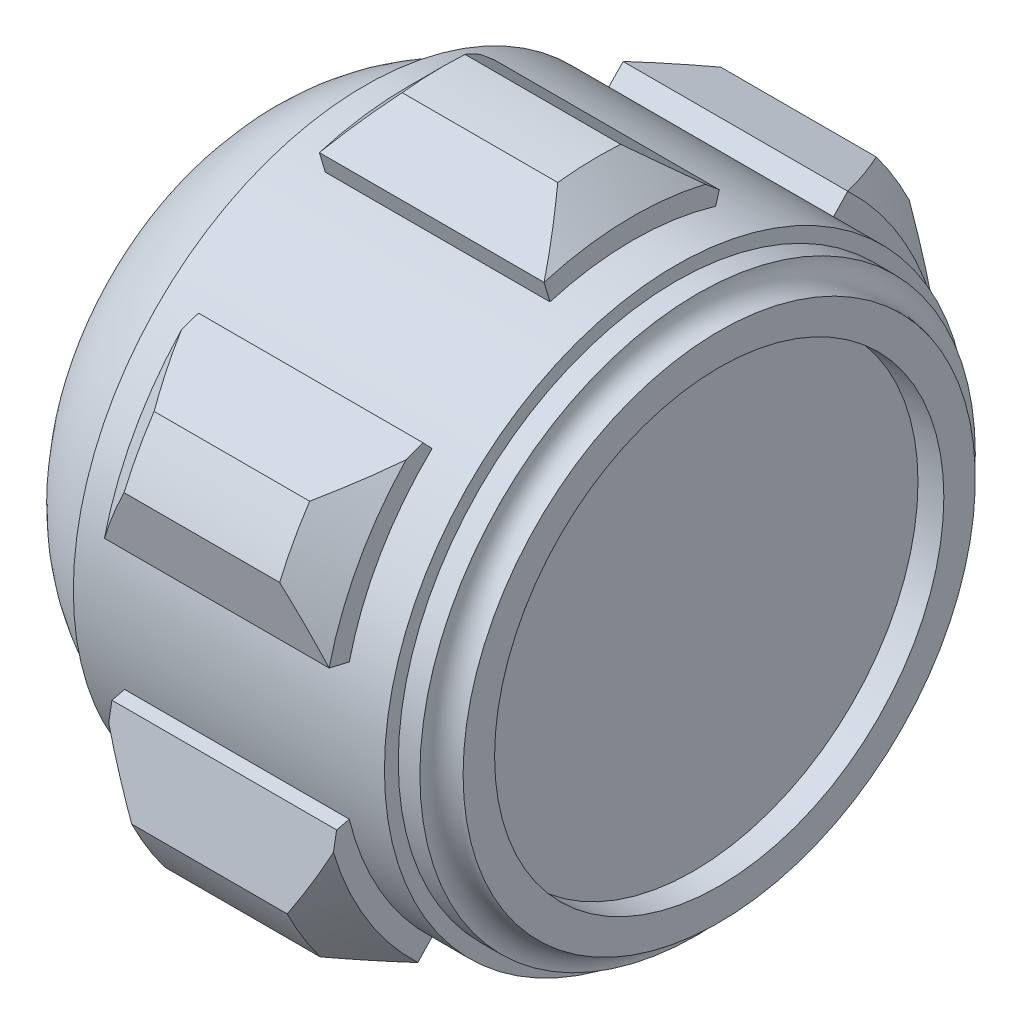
ISO-10303-21;
HEADER;
FILE_DESCRIPTION(('STEP AP214'),'2;1');
FILE_NAME('part.step','',(''),(''),'','','');
FILE_SCHEMA(('AUTOMOTIVE_DESIGN { 1 0 10303 214 1 1 1 1 }'));
ENDSEC;
DATA;
#1=APPLICATION_CONTEXT('core data for automotive mechanical design processes');
#2=APPLICATION_PROTOCOL_DEFINITION('international standard','automotive_design',2000,#1);
#3=PRODUCT_CONTEXT('',#1,'mechanical');
#4=PRODUCT('Part','Part','',(#3));
#5=PRODUCT_RELATED_PRODUCT_CATEGORY('part','',(#4));
#6=PRODUCT_DEFINITION_FORMATION('','',#4);
#7=PRODUCT_DEFINITION_CONTEXT('part definition',#1,'design');
#8=PRODUCT_DEFINITION('design','',#6,#7);
#9=PRODUCT_DEFINITION_SHAPE('','',#8);
#10=(LENGTH_UNIT() NAMED_UNIT(*) SI_UNIT(.MILLI.,.METRE.));
#11=(NAMED_UNIT(*) PLANE_ANGLE_UNIT() SI_UNIT($,.RADIAN.));
#12=(NAMED_UNIT(*) SI_UNIT($,.STERADIAN.) SOLID_ANGLE_UNIT());
#13=UNCERTAINTY_MEASURE_WITH_UNIT(LENGTH_MEASURE(1.E-05),#10,'distance_accuracy_value','');
#14=(GEOMETRIC_REPRESENTATION_CONTEXT(3) GLOBAL_UNCERTAINTY_ASSIGNED_CONTEXT((#13)) GLOBAL_UNIT_ASSIGNED_CONTEXT((#10,
#11,#12)) REPRESENTATION_CONTEXT('',''));
#15=CARTESIAN_POINT('',(0.,0.,0.));
#16=DIRECTION('',(0.,0.,1.));
#17=DIRECTION('',(1.,0.,0.));
#18=AXIS2_PLACEMENT_3D('',#15,#16,#17);
#19=CARTESIAN_POINT('',(36.195,45.71498772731,-25.62336));
#20=DIRECTION('',(-1.,0.,0.));
#21=DIRECTION('',(0.,-1.,0.));
#22=AXIS2_PLACEMENT_3D('',#19,#20,#21);
#23=PLANE('',#22);
#24=CARTESIAN_POINT('',(36.195,0.,0.));
#25=DIRECTION('',(-1.,0.,0.));
#26=DIRECTION('',(0.,0.,1.));
#27=AXIS2_PLACEMENT_3D('',#24,#25,#26);
#28=CIRCLE('',#27,18.81886);
#29=CARTESIAN_POINT('',(36.195,0.,18.81886));
#30=VERTEX_POINT('',#29);
#31=EDGE_CURVE('E39',#30,#30,#28,.T.);
#32=ORIENTED_EDGE('',*,*,#31,.F.);
#33=EDGE_LOOP('',(#32));
#34=FACE_BOUND('',#33,.T.);
#35=CARTESIAN_POINT('',(36.195,0.,0.));
#36=DIRECTION('',(-1.,0.,0.));
#37=DIRECTION('',(0.,-1.,0.));
#38=AXIS2_PLACEMENT_3D('',#35,#36,#37);
#39=CIRCLE('',#38,16.5055657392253);
#40=CARTESIAN_POINT('',(36.195,-16.5055657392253,0.));
#41=VERTEX_POINT('',#40);
#42=EDGE_CURVE('E616',#41,#41,#39,.F.);
#43=ORIENTED_EDGE('',*,*,#42,.F.);
#44=EDGE_LOOP('',(#43));
#45=FACE_BOUND('',#44,.T.);
#46=ADVANCED_FACE('F35',(#34,#45),#23,.F.);
#47=CARTESIAN_POINT('',(0.,0.,0.));
#48=DIRECTION('',(-1.,0.,0.));
#49=DIRECTION('',(0.,0.866025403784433,0.50000000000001));
#50=AXIS2_PLACEMENT_3D('',#47,#48,#49);
#51=CYLINDRICAL_SURFACE('',#50,25.48636);
#52=CARTESIAN_POINT('',(27.305,0.,0.));
#53=DIRECTION('',(-1.,0.,0.));
#54=DIRECTION('',(0.,0.,1.));
#55=AXIS2_PLACEMENT_3D('',#52,#53,#54);
#56=CIRCLE('',#55,25.48636);
#57=CARTESIAN_POINT('',(27.305,15.2323900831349,-20.4335224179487));
#58=VERTEX_POINT('',#57);
#59=CARTESIAN_POINT('',(27.305,11.2884614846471,-22.8500587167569));
#60=VERTEX_POINT('',#59);
#61=EDGE_CURVE('E324',#58,#60,#56,.T.);
#62=ORIENTED_EDGE('',*,*,#61,.T.);
#63=DIRECTION('',(-1.,0.,0.));
#64=VECTOR('',#63,1.);
#65=CARTESIAN_POINT('',(0.,11.2884614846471,-22.8500587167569));
#66=LINE('',#65,#64);
#67=CARTESIAN_POINT('',(15.875,11.2884614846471,-22.8500587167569));
#68=VERTEX_POINT('',#67);
#69=EDGE_CURVE('E330',#60,#68,#66,.T.);
#70=ORIENTED_EDGE('',*,*,#69,.T.);
#71=CARTESIAN_POINT('',(15.875,0.,0.));
#72=DIRECTION('',(1.,0.,0.));
#73=DIRECTION('',(0.,0.,-1.));
#74=AXIS2_PLACEMENT_3D('',#71,#72,#73);
#75=CIRCLE('',#74,25.48636);
#76=CARTESIAN_POINT('',(15.875,15.2323900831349,-20.4335224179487));
#77=VERTEX_POINT('',#76);
#78=EDGE_CURVE('E847',#68,#77,#75,.T.);
#79=ORIENTED_EDGE('',*,*,#78,.T.);
#80=DIRECTION('',(-1.,0.,0.));
#81=VECTOR('',#80,1.);
#82=CARTESIAN_POINT('',(0.,15.2323900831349,-20.4335224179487));
#83=LINE('',#82,#81);
#84=EDGE_CURVE('E1050',#77,#58,#83,.F.);
#85=ORIENTED_EDGE('',*,*,#84,.T.);
#86=EDGE_LOOP('',(#62,#70,#79,#85));
#87=FACE_BOUND('',#86,.T.);
#88=ADVANCED_FACE('F563',(#87),#51,.T.);
#89=CARTESIAN_POINT('',(0.,0.,0.));
#90=DIRECTION('',(-1.,0.,0.));
#91=DIRECTION('',(0.,0.,-1.));
#92=AXIS2_PLACEMENT_3D('',#89,#90,#91);
#93=CYLINDRICAL_SURFACE('',#92,25.48636);
#94=CARTESIAN_POINT('',(27.3050000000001,0.,0.));
#95=DIRECTION('',(-1.,0.,0.));
#96=DIRECTION('',(0.,0.,1.));
#97=AXIS2_PLACEMENT_3D('',#94,#95,#96);
#98=CIRCLE('',#97,25.48636);
#99=CARTESIAN_POINT('',(27.3050000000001,-25.3121445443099,-2.97487556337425));
#100=VERTEX_POINT('',#99);
#101=CARTESIAN_POINT('',(27.3050000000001,-25.4329620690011,1.64893494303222));
#102=VERTEX_POINT('',#101);
#103=EDGE_CURVE('E826',#100,#102,#98,.T.);
#104=ORIENTED_EDGE('',*,*,#103,.T.);
#105=DIRECTION('',(-1.,0.,0.));
#106=VECTOR('',#105,1.);
#107=CARTESIAN_POINT('',(0.,-25.4329620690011,1.64893494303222));
#108=LINE('',#107,#106);
#109=CARTESIAN_POINT('',(15.875,-25.4329620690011,1.64893494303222));
#110=VERTEX_POINT('',#109);
#111=EDGE_CURVE('E949',#102,#110,#108,.T.);
#112=ORIENTED_EDGE('',*,*,#111,.T.);
#113=CARTESIAN_POINT('',(15.875,0.,0.));
#114=DIRECTION('',(1.,0.,0.));
#115=DIRECTION('',(0.,0.,-1.));
#116=AXIS2_PLACEMENT_3D('',#113,#114,#115);
#117=CIRCLE('',#116,25.48636);
#118=CARTESIAN_POINT('',(15.875,-25.3121445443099,-2.97487556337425));
#119=VERTEX_POINT('',#118);
#120=EDGE_CURVE('E823',#110,#119,#117,.T.);
#121=ORIENTED_EDGE('',*,*,#120,.T.);
#122=DIRECTION('',(-1.,0.,0.));
#123=VECTOR('',#122,1.);
#124=CARTESIAN_POINT('',(0.,-25.3121445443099,-2.97487556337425));
#125=LINE('',#124,#123);
#126=EDGE_CURVE('E946',#119,#100,#125,.F.);
#127=ORIENTED_EDGE('',*,*,#126,.T.);
#128=EDGE_LOOP('',(#104,#112,#121,#127));
#129=FACE_BOUND('',#128,.T.);
#130=ADVANCED_FACE('F523',(#129),#93,.T.);
#131=CARTESIAN_POINT('',(0.,0.,0.));
#132=DIRECTION('',(-1.,0.,0.));
#133=DIRECTION('',(0.,-0.86602540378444,0.499999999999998));
#134=AXIS2_PLACEMENT_3D('',#131,#132,#133);
#135=CYLINDRICAL_SURFACE('',#134,25.48636);
#136=CARTESIAN_POINT('',(27.305,0.,0.));
#137=DIRECTION('',(-1.,0.,0.));
#138=DIRECTION('',(0.,0.,1.));
#139=AXIS2_PLACEMENT_3D('',#136,#137,#138);
#140=CIRCLE('',#139,25.48636);
#141=CARTESIAN_POINT('',(27.305,10.0797544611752,23.4083979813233));
#142=VERTEX_POINT('',#141);
#143=CARTESIAN_POINT('',(27.305,14.1445005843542,21.2011237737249));
#144=VERTEX_POINT('',#143);
#145=EDGE_CURVE('E800',#142,#144,#140,.T.);
#146=ORIENTED_EDGE('',*,*,#145,.T.);
#147=DIRECTION('',(-1.,0.,0.));
#148=VECTOR('',#147,1.);
#149=CARTESIAN_POINT('',(0.,14.1445005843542,21.2011237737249));
#150=LINE('',#149,#148);
#151=CARTESIAN_POINT('',(15.875,14.1445005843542,21.2011237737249));
#152=VERTEX_POINT('',#151);
#153=EDGE_CURVE('E855',#144,#152,#150,.T.);
#154=ORIENTED_EDGE('',*,*,#153,.T.);
#155=CARTESIAN_POINT('',(15.875,0.,0.));
#156=DIRECTION('',(1.,0.,0.));
#157=DIRECTION('',(0.,0.,-1.));
#158=AXIS2_PLACEMENT_3D('',#155,#156,#157);
#159=CIRCLE('',#158,25.48636);
#160=CARTESIAN_POINT('',(15.875,10.0797544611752,23.4083979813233));
#161=VERTEX_POINT('',#160);
#162=EDGE_CURVE('E796',#152,#161,#159,.T.);
#163=ORIENTED_EDGE('',*,*,#162,.T.);
#164=DIRECTION('',(-1.,0.,0.));
#165=VECTOR('',#164,1.);
#166=CARTESIAN_POINT('',(0.,10.0797544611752,23.4083979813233));
#167=LINE('',#166,#165);
#168=EDGE_CURVE('E853',#161,#142,#167,.F.);
#169=ORIENTED_EDGE('',*,*,#168,.T.);
#170=EDGE_LOOP('',(#146,#154,#163,#169));
#171=FACE_BOUND('',#170,.T.);
#172=ADVANCED_FACE('F491',(#171),#135,.T.);
#173=CARTESIAN_POINT('',(0.,0.,0.));
#174=DIRECTION('',(1.,0.,0.));
#175=DIRECTION('',(0.,0.,-1.));
#176=AXIS2_PLACEMENT_3D('',#173,#174,#175);
#177=PLANE('',#176);
#178=CARTESIAN_POINT('',(0.,0.,0.));
#179=DIRECTION('',(1.,0.,0.));
#180=DIRECTION('',(0.,0.,-1.));
#181=AXIS2_PLACEMENT_3D('',#178,#179,#180);
#182=CIRCLE('',#181,7.96295210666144);
#183=CARTESIAN_POINT('',(0.,0.,-7.96295210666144));
#184=VERTEX_POINT('',#183);
#185=EDGE_CURVE('E335',#184,#184,#182,.F.);
#186=ORIENTED_EDGE('',*,*,#185,.T.);
#187=EDGE_LOOP('',(#186));
#188=FACE_BOUND('',#187,.T.);
#189=ADVANCED_FACE('F487',(#188),#177,.F.);
#190=CARTESIAN_POINT('',(0.,0.,0.));
#191=DIRECTION('',(-1.,0.,0.));
#192=DIRECTION('',(0.,0.,1.));
#193=AXIS2_PLACEMENT_3D('',#190,#191,#192);
#194=CYLINDRICAL_SURFACE('',#193,25.48636);
#195=CARTESIAN_POINT('',(27.305,0.,0.));
#196=DIRECTION('',(-1.,0.,0.));
#197=DIRECTION('',(0.,0.,1.));
#198=AXIS2_PLACEMENT_3D('',#195,#196,#197);
#199=CIRCLE('',#198,25.48636);
#200=CARTESIAN_POINT('',(27.305,25.3121445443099,2.97487556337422));
#201=VERTEX_POINT('',#200);
#202=CARTESIAN_POINT('',(27.305,25.4329620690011,-1.64893494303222));
#203=VERTEX_POINT('',#202);
#204=EDGE_CURVE('E763',#201,#203,#199,.T.);
#205=ORIENTED_EDGE('',*,*,#204,.T.);
#206=DIRECTION('',(-1.,0.,0.));
#207=VECTOR('',#206,1.);
#208=CARTESIAN_POINT('',(0.,25.4329620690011,-1.64893494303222));
#209=LINE('',#208,#207);
#210=CARTESIAN_POINT('',(15.875,25.4329620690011,-1.64893494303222));
#211=VERTEX_POINT('',#210);
#212=EDGE_CURVE('E773',#203,#211,#209,.T.);
#213=ORIENTED_EDGE('',*,*,#212,.T.);
#214=CARTESIAN_POINT('',(15.875,0.,0.));
#215=DIRECTION('',(1.,0.,0.));
#216=DIRECTION('',(0.,0.,-1.));
#217=AXIS2_PLACEMENT_3D('',#214,#215,#216);
#218=CIRCLE('',#217,25.48636);
#219=CARTESIAN_POINT('',(15.875,25.3121445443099,2.97487556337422));
#220=VERTEX_POINT('',#219);
#221=EDGE_CURVE('E760',#211,#220,#218,.T.);
#222=ORIENTED_EDGE('',*,*,#221,.T.);
#223=DIRECTION('',(-1.,0.,0.));
#224=VECTOR('',#223,1.);
#225=CARTESIAN_POINT('',(0.,25.3121445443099,2.97487556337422));
#226=LINE('',#225,#224);
#227=EDGE_CURVE('E772',#220,#201,#226,.F.);
#228=ORIENTED_EDGE('',*,*,#227,.T.);
#229=EDGE_LOOP('',(#205,#213,#222,#228));
#230=FACE_BOUND('',#229,.T.);
#231=ADVANCED_FACE('F490',(#230),#194,.T.);
#232=CARTESIAN_POINT('',(0.,0.,0.));
#233=DIRECTION('',(-1.,0.,0.));
#234=DIRECTION('',(0.,-0.866025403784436,-0.500000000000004));
#235=AXIS2_PLACEMENT_3D('',#232,#233,#234);
#236=CYLINDRICAL_SURFACE('',#235,25.48636);
#237=CARTESIAN_POINT('',(27.305,0.,0.));
#238=DIRECTION('',(-1.,0.,0.));
#239=DIRECTION('',(0.,0.,1.));
#240=AXIS2_PLACEMENT_3D('',#237,#238,#239);
#241=CIRCLE('',#240,25.48636);
#242=CARTESIAN_POINT('',(27.305,-15.2323900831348,20.4335224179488));
#243=VERTEX_POINT('',#242);
#244=CARTESIAN_POINT('',(27.305,-11.2884614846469,22.850058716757));
#245=VERTEX_POINT('',#244);
#246=EDGE_CURVE('E814',#243,#245,#241,.T.);
#247=ORIENTED_EDGE('',*,*,#246,.T.);
#248=DIRECTION('',(-1.,0.,0.));
#249=VECTOR('',#248,1.);
#250=CARTESIAN_POINT('',(0.,-11.2884614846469,22.850058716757));
#251=LINE('',#250,#249);
#252=CARTESIAN_POINT('',(15.875,-11.2884614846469,22.850058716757));
#253=VERTEX_POINT('',#252);
#254=EDGE_CURVE('E883',#245,#253,#251,.T.);
#255=ORIENTED_EDGE('',*,*,#254,.T.);
#256=CARTESIAN_POINT('',(15.875,0.,0.));
#257=DIRECTION('',(1.,0.,0.));
#258=DIRECTION('',(0.,0.,-1.));
#259=AXIS2_PLACEMENT_3D('',#256,#257,#258);
#260=CIRCLE('',#259,25.48636);
#261=CARTESIAN_POINT('',(15.875,-15.2323900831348,20.4335224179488));
#262=VERTEX_POINT('',#261);
#263=EDGE_CURVE('E811',#253,#262,#260,.T.);
#264=ORIENTED_EDGE('',*,*,#263,.T.);
#265=DIRECTION('',(-1.,0.,0.));
#266=VECTOR('',#265,1.);
#267=CARTESIAN_POINT('',(0.,-15.2323900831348,20.4335224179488));
#268=LINE('',#267,#266);
#269=EDGE_CURVE('E882',#262,#243,#268,.F.);
#270=ORIENTED_EDGE('',*,*,#269,.T.);
#271=EDGE_LOOP('',(#247,#255,#264,#270));
#272=FACE_BOUND('',#271,.T.);
#273=ADVANCED_FACE('F504',(#272),#236,.T.);
#274=CARTESIAN_POINT('',(0.,0.,0.));
#275=DIRECTION('',(-1.,0.,0.));
#276=DIRECTION('',(0.,0.866025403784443,-0.499999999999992));
#277=AXIS2_PLACEMENT_3D('',#274,#275,#276);
#278=CYLINDRICAL_SURFACE('',#277,25.48636);
#279=CARTESIAN_POINT('',(27.3049999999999,0.,0.));
#280=DIRECTION('',(-1.,0.,0.));
#281=DIRECTION('',(0.,0.,1.));
#282=AXIS2_PLACEMENT_3D('',#279,#280,#281);
#283=CIRCLE('',#282,25.48636);
#284=CARTESIAN_POINT('',(27.3049999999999,-10.079754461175,-23.4083979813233));
#285=VERTEX_POINT('',#284);
#286=CARTESIAN_POINT('',(27.3049999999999,-14.1445005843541,-21.201123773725));
#287=VERTEX_POINT('',#286);
#288=EDGE_CURVE('E838',#285,#287,#283,.T.);
#289=ORIENTED_EDGE('',*,*,#288,.T.);
#290=DIRECTION('',(-1.,0.,0.));
#291=VECTOR('',#290,1.);
#292=CARTESIAN_POINT('',(0.,-14.1445005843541,-21.201123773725));
#293=LINE('',#292,#291);
#294=CARTESIAN_POINT('',(15.875,-14.1445005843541,-21.201123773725));
#295=VERTEX_POINT('',#294);
#296=EDGE_CURVE('E1011',#287,#295,#293,.T.);
#297=ORIENTED_EDGE('',*,*,#296,.T.);
#298=CARTESIAN_POINT('',(15.875,0.,0.));
#299=DIRECTION('',(1.,0.,0.));
#300=DIRECTION('',(0.,0.,-1.));
#301=AXIS2_PLACEMENT_3D('',#298,#299,#300);
#302=CIRCLE('',#301,25.48636);
#303=CARTESIAN_POINT('',(15.875,-10.079754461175,-23.4083979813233));
#304=VERTEX_POINT('',#303);
#305=EDGE_CURVE('E835',#295,#304,#302,.T.);
#306=ORIENTED_EDGE('',*,*,#305,.T.);
#307=DIRECTION('',(-1.,0.,0.));
#308=VECTOR('',#307,1.);
#309=CARTESIAN_POINT('',(0.,-10.079754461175,-23.4083979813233));
#310=LINE('',#309,#308);
#311=EDGE_CURVE('E1008',#304,#285,#310,.F.);
#312=ORIENTED_EDGE('',*,*,#311,.T.);
#313=EDGE_LOOP('',(#289,#297,#306,#312));
#314=FACE_BOUND('',#313,.T.);
#315=ADVANCED_FACE('F544',(#314),#278,.T.);
#316=CARTESIAN_POINT('',(27.305,0.,0.));
#317=DIRECTION('',(-1.,0.,0.));
#318=DIRECTION('',(0.,0.,1.));
#319=AXIS2_PLACEMENT_3D('',#316,#317,#318);
#320=CONICAL_SURFACE('',#319,25.48636,0.785398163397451);
#321=CARTESIAN_POINT('',(29.845,0.,0.));
#322=DIRECTION('',(-1.,0.,0.));
#323=DIRECTION('',(0.,0.,1.));
#324=AXIS2_PLACEMENT_3D('',#321,#322,#323);
#325=CIRCLE('',#324,22.94636);
#326=CARTESIAN_POINT('',(29.845,6.53806936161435,-21.9952059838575));
#327=VERTEX_POINT('',#326);
#328=CARTESIAN_POINT('',(29.845,16.6447014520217,-15.7952319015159));
#329=VERTEX_POINT('',#328);
#330=EDGE_CURVE('E311',#327,#329,#325,.F.);
#331=ORIENTED_EDGE('',*,*,#330,.F.);
#332=CARTESIAN_POINT('',(29.845,6.53806936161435,-21.9952059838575));
#333=CARTESIAN_POINT('',(29.6581829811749,6.94640196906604,-22.0686871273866));
#334=CARTESIAN_POINT('',(29.4639913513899,7.35140085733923,-22.1415683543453));
#335=CARTESIAN_POINT('',(29.0627650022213,8.1547974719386,-22.2861429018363));
#336=CARTESIAN_POINT('',(28.855740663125,8.55320021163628,-22.3578371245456));
#337=CARTESIAN_POINT('',(28.4304793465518,9.34406915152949,-22.5001572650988));
#338=CARTESIAN_POINT('',(28.212243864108,9.7365361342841,-22.5707833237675));
#339=CARTESIAN_POINT('',(27.7657535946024,10.5163301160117,-22.7111104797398));
#340=CARTESIAN_POINT('',(27.5374909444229,10.9036527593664,-22.7808107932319));
#341=CARTESIAN_POINT('',(27.305,11.2884614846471,-22.8500587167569));
#342=B_SPLINE_CURVE_WITH_KNOTS('',3,(#332,#333,#334,#335,#336,#337,#338,#339,#340,#341),
.UNSPECIFIED.,.F.,.F.,(4,2,2,2,4),(0.,1.3648753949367,2.72866080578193,4.09226482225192,
5.45695793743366),.UNSPECIFIED.);
#343=EDGE_CURVE('E321',#327,#60,#342,.T.);
#344=ORIENTED_EDGE('',*,*,#343,.T.);
#345=ORIENTED_EDGE('',*,*,#61,.F.);
#346=CARTESIAN_POINT('',(27.305,15.2323900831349,-20.4335224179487));
#347=CARTESIAN_POINT('',(27.5377894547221,15.3467771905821,-20.0578541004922));
#348=CARTESIAN_POINT('',(27.766292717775,15.4619163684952,-19.6797158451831));
#349=CARTESIAN_POINT('',(28.213120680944,15.6937331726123,-18.9183867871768));
#350=CARTESIAN_POINT('',(28.4314535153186,15.8104094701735,-18.5352003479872));
#351=CARTESIAN_POINT('',(28.8567469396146,16.0455365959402,-17.7629995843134));
#352=CARTESIAN_POINT('',(29.0637059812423,16.1639876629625,-17.3739844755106));
#353=CARTESIAN_POINT('',(29.4646124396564,16.4028602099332,-16.5894830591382));
#354=CARTESIAN_POINT('',(29.6585491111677,16.5232832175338,-16.1939917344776));
#355=CARTESIAN_POINT('',(29.8449999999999,16.6447014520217,-15.7952319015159));
#356=B_SPLINE_CURVE_WITH_KNOTS('',3,(#346,#347,#348,#349,#350,#351,#352,#353,#354,#355),
.UNSPECIFIED.,.F.,.F.,(4,2,2,2,4),(0.,1.36955539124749,2.73799592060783,4.10662227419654,
5.47636440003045),.UNSPECIFIED.);
#357=EDGE_CURVE('E316',#58,#329,#356,.T.);
#358=ORIENTED_EDGE('',*,*,#357,.T.);
#359=EDGE_LOOP('',(#331,#344,#345,#358));
#360=FACE_BOUND('',#359,.T.);
#361=ADVANCED_FACE('F319',(#360),#320,.T.);
#362=CARTESIAN_POINT('',(0.,11.2884614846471,-22.8500587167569));
#363=DIRECTION('',(0.,0.177109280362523,0.984191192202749));
#364=DIRECTION('',(-1.,0.,0.));
#365=AXIS2_PLACEMENT_3D('',#362,#363,#364);
#366=PLANE('',#365);
#367=DIRECTION('',(0.,-0.98419119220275,0.177109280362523));
#368=VECTOR('',#367,1.);
#369=CARTESIAN_POINT('',(29.845,11.2884614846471,-22.8500587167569));
#370=LINE('',#369,#368);
#371=CARTESIAN_POINT('',(29.845,5.22380121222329,-21.7586979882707));
#372=VERTEX_POINT('',#371);
#373=EDGE_CURVE('E308',#372,#327,#370,.F.);
#374=ORIENTED_EDGE('',*,*,#373,.F.);
#375=DIRECTION('',(1.,0.,0.));
#376=VECTOR('',#375,1.);
#377=CARTESIAN_POINT('',(27.305,5.2238012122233,-21.7586979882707));
#378=LINE('',#377,#376);
#379=CARTESIAN_POINT('',(13.335,5.2238012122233,-21.7586979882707));
#380=VERTEX_POINT('',#379);
#381=EDGE_CURVE('E315',#380,#372,#378,.T.);
#382=ORIENTED_EDGE('',*,*,#381,.F.);
#383=DIRECTION('',(0.,0.98419119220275,-0.177109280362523));
#384=VECTOR('',#383,1.);
#385=CARTESIAN_POINT('',(13.335,11.2884614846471,-22.8500587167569));
#386=LINE('',#385,#384);
#387=CARTESIAN_POINT('',(13.335,6.53806936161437,-21.9952059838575));
#388=VERTEX_POINT('',#387);
#389=EDGE_CURVE('E369',#388,#380,#386,.F.);
#390=ORIENTED_EDGE('',*,*,#389,.F.);
#391=CARTESIAN_POINT('',(15.875,11.2884614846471,-22.8500587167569));
#392=CARTESIAN_POINT('',(15.6425090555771,10.9036527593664,-22.7808107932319));
#393=CARTESIAN_POINT('',(15.4142464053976,10.5163301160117,-22.7111104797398));
#394=CARTESIAN_POINT('',(14.967756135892,9.73653613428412,-22.5707833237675));
#395=CARTESIAN_POINT('',(14.7495206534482,9.34406915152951,-22.5001572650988));
#396=CARTESIAN_POINT('',(14.324259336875,8.5532002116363,-22.3578371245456));
#397=CARTESIAN_POINT('',(14.1172349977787,8.15479747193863,-22.2861429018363));
#398=CARTESIAN_POINT('',(13.7160086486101,7.35140085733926,-22.1415683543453));
#399=CARTESIAN_POINT('',(13.5218170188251,6.94640196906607,-22.0686871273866));
#400=CARTESIAN_POINT('',(13.335,6.53806936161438,-21.9952059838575));
#401=B_SPLINE_CURVE_WITH_KNOTS('',3,(#391,#392,#393,#394,#395,#396,#397,#398,#399,#400),
.UNSPECIFIED.,.F.,.F.,(4,2,2,2,4),(0.,1.36469311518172,2.72829713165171,4.09208254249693,
5.45695793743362),.UNSPECIFIED.);
#402=EDGE_CURVE('E362',#68,#388,#401,.T.);
#403=ORIENTED_EDGE('',*,*,#402,.F.);
#404=ORIENTED_EDGE('',*,*,#69,.F.);
#405=ORIENTED_EDGE('',*,*,#343,.F.);
#406=EDGE_LOOP('',(#374,#382,#390,#403,#404,#405));
#407=FACE_BOUND('',#406,.T.);
#408=ADVANCED_FACE('F328',(#407),#366,.F.);
#409=CARTESIAN_POINT('',(13.335,0.,0.));
#410=DIRECTION('',(1.,0.,0.));
#411=DIRECTION('',(0.,0.,-1.));
#412=AXIS2_PLACEMENT_3D('',#409,#410,#411);
#413=CONICAL_SURFACE('',#412,22.94636,0.78539816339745);
#414=ORIENTED_EDGE('',*,*,#78,.F.);
#415=ORIENTED_EDGE('',*,*,#402,.T.);
#416=CARTESIAN_POINT('',(13.335,0.,0.));
#417=DIRECTION('',(1.,0.,0.));
#418=DIRECTION('',(0.,0.,-1.));
#419=AXIS2_PLACEMENT_3D('',#416,#417,#418);
#420=CIRCLE('',#419,22.94636);
#421=CARTESIAN_POINT('',(13.335,16.6447014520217,-15.7952319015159));
#422=VERTEX_POINT('',#421);
#423=EDGE_CURVE('E325',#422,#388,#420,.F.);
#424=ORIENTED_EDGE('',*,*,#423,.F.);
#425=CARTESIAN_POINT('',(13.335,16.6447014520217,-15.795231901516));
#426=CARTESIAN_POINT('',(13.5214508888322,16.5232832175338,-16.1939917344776));
#427=CARTESIAN_POINT('',(13.7153875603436,16.4028602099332,-16.5894830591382));
#428=CARTESIAN_POINT('',(14.1162940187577,16.1639876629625,-17.3739844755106));
#429=CARTESIAN_POINT('',(14.3232530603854,16.0455365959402,-17.7629995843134));
#430=CARTESIAN_POINT('',(14.7485464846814,15.8104094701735,-18.5352003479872));
#431=CARTESIAN_POINT('',(14.9668793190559,15.6937331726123,-18.9183867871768));
#432=CARTESIAN_POINT('',(15.413707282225,15.4619163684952,-19.6797158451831));
#433=CARTESIAN_POINT('',(15.6422105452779,15.3467771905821,-20.0578541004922));
#434=CARTESIAN_POINT('',(15.875,15.2323900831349,-20.4335224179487));
#435=B_SPLINE_CURVE_WITH_KNOTS('',3,(#425,#426,#427,#428,#429,#430,#431,#432,#433,#434),
.UNSPECIFIED.,.F.,.F.,(4,2,2,2,4),(0.,1.36974212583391,2.73836847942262,4.10680900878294,
5.47636440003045),.UNSPECIFIED.);
#436=EDGE_CURVE('E368',#422,#77,#435,.T.);
#437=ORIENTED_EDGE('',*,*,#436,.T.);
#438=EDGE_LOOP('',(#414,#415,#424,#437));
#439=FACE_BOUND('',#438,.T.);
#440=ADVANCED_FACE('F353',(#439),#413,.T.);
#441=CARTESIAN_POINT('',(0.,16.6447014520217,-15.795231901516));
#442=DIRECTION('',(0.,-0.956636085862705,0.291285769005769));
#443=DIRECTION('',(-1.,0.,0.));
#444=AXIS2_PLACEMENT_3D('',#441,#442,#443);
#445=PLANE('',#444);
#446=ORIENTED_EDGE('',*,*,#357,.F.);
#447=ORIENTED_EDGE('',*,*,#84,.F.);
#448=ORIENTED_EDGE('',*,*,#436,.F.);
#449=DIRECTION('',(-1.,0.,0.));
#450=VECTOR('',#449,1.);
#451=CARTESIAN_POINT('',(0.,16.6447014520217,-15.795231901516));
#452=LINE('',#451,#450);
#453=EDGE_CURVE('E331',#329,#422,#452,.T.);
#454=ORIENTED_EDGE('',*,*,#453,.F.);
#455=EDGE_LOOP('',(#446,#447,#448,#454));
#456=FACE_BOUND('',#455,.T.);
#457=ADVANCED_FACE('F354',(#456),#445,.F.);
#458=CARTESIAN_POINT('',(27.3050000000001,0.,0.));
#459=DIRECTION('',(-1.,0.,0.));
#460=DIRECTION('',(0.,0.,1.));
#461=AXIS2_PLACEMENT_3D('',#458,#459,#460);
#462=CONICAL_SURFACE('',#461,25.48636,0.785398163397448);
#463=CARTESIAN_POINT('',(29.845,0.,0.));
#464=DIRECTION('',(-1.,0.,0.));
#465=DIRECTION('',(0.,0.,1.));
#466=AXIS2_PLACEMENT_3D('',#463,#464,#465);
#467=CIRCLE('',#466,22.9463600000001);
#468=CARTESIAN_POINT('',(29.845,-22.3174418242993,5.33546883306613));
#469=VERTEX_POINT('',#468);
#470=CARTESIAN_POINT('',(29.845,-22.0014228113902,-6.51711834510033));
#471=VERTEX_POINT('',#470);
#472=EDGE_CURVE('E829',#469,#471,#467,.F.);
#473=ORIENTED_EDGE('',*,*,#472,.F.);
#474=CARTESIAN_POINT('',(29.845,-22.3174418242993,5.33546883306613));
#475=CARTESIAN_POINT('',(29.6581829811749,-22.5852446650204,5.01858299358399));
#476=CARTESIAN_POINT('',(29.4639913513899,-22.8508611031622,4.70428428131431));
#477=CARTESIAN_POINT('',(29.0627650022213,-23.3777646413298,4.08080967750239));
#478=CARTESIAN_POINT('',(28.855740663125,-23.6390550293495,3.77162989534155));
#479=CARTESIAN_POINT('',(28.4304793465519,-24.1577423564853,3.15787737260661));
#480=CARTESIAN_POINT('',(28.2122438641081,-24.4151398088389,2.85330402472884));
#481=CARTESIAN_POINT('',(27.7657535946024,-24.9265636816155,2.24814620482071));
#482=CARTESIAN_POINT('',(27.5374909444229,-25.1805872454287,1.94756511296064));
#483=CARTESIAN_POINT('',(27.3050000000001,-25.4329620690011,1.64893494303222));
#484=B_SPLINE_CURVE_WITH_KNOTS('',3,(#474,#475,#476,#477,#478,#479,#480,#481,#482,#483),
.UNSPECIFIED.,.F.,.F.,(4,2,2,2,4),(0.,1.36487539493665,2.72866080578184,4.09226482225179,
5.45695793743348),.UNSPECIFIED.);
#485=EDGE_CURVE('E982',#469,#102,#484,.T.);
#486=ORIENTED_EDGE('',*,*,#485,.T.);
#487=ORIENTED_EDGE('',*,*,#103,.F.);
#488=CARTESIAN_POINT('',(27.3050000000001,-25.3121445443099,-2.97487556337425));
#489=CARTESIAN_POINT('',(27.5377894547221,-25.0439997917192,-3.26177186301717));
#490=CARTESIAN_POINT('',(27.7662927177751,-24.7740920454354,-3.5505544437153));
#491=CARTESIAN_POINT('',(28.2131206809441,-24.2306701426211,-4.13197821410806));
#492=CARTESIAN_POINT('',(28.4314535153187,-23.9571591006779,-4.42461607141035));
#493=CARTESIAN_POINT('',(28.8567469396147,-23.4059771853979,-5.01434251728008));
#494=CARTESIAN_POINT('',(29.0637059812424,-23.1283057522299,-5.31143170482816));
#495=CARTESIAN_POINT('',(29.4646124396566,-22.5683438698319,-5.91055210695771));
#496=CARTESIAN_POINT('',(29.6585491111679,-22.2860498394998,-6.21258715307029));
#497=CARTESIAN_POINT('',(29.8450000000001,-22.0014228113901,-6.51711834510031));
#498=B_SPLINE_CURVE_WITH_KNOTS('',3,(#488,#489,#490,#491,#492,#493,#494,#495,#496,#497),
.UNSPECIFIED.,.F.,.F.,(4,2,2,2,4),(0.,1.36955539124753,2.73799592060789,4.10662227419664,
5.47636440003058),.UNSPECIFIED.);
#499=EDGE_CURVE('E975',#100,#471,#498,.T.);
#500=ORIENTED_EDGE('',*,*,#499,.T.);
#501=EDGE_LOOP('',(#473,#486,#487,#500));
#502=FACE_BOUND('',#501,.T.);
#503=ADVANCED_FACE('F988',(#502),#462,.T.);
#504=CARTESIAN_POINT('',(0.,-25.4329620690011,1.64893494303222));
#505=DIRECTION('',(0.,0.763779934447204,-0.64547673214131));
#506=DIRECTION('',(-1.,0.,0.));
#507=AXIS2_PLACEMENT_3D('',#504,#505,#506);
#508=PLANE('',#507);
#509=DIRECTION('',(0.,0.64547673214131,0.763779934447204));
#510=VECTOR('',#509,1.);
#511=CARTESIAN_POINT('',(29.845,-25.4329620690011,1.64893494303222));
#512=LINE('',#511,#510);
#513=CARTESIAN_POINT('',(29.845,-21.4554858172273,6.35540444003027));
#514=VERTEX_POINT('',#513);
#515=EDGE_CURVE('E981',#514,#469,#512,.F.);
#516=ORIENTED_EDGE('',*,*,#515,.F.);
#517=DIRECTION('',(1.,0.,0.));
#518=VECTOR('',#517,1.);
#519=CARTESIAN_POINT('',(27.305,-21.4554858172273,6.35540444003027));
#520=LINE('',#519,#518);
#521=CARTESIAN_POINT('',(13.335,-21.4554858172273,6.35540444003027));
#522=VERTEX_POINT('',#521);
#523=EDGE_CURVE('E1484',#522,#514,#520,.T.);
#524=ORIENTED_EDGE('',*,*,#523,.F.);
#525=DIRECTION('',(0.,-0.64547673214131,-0.763779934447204));
#526=VECTOR('',#525,1.);
#527=CARTESIAN_POINT('',(13.335,-25.4329620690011,1.64893494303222));
#528=LINE('',#527,#526);
#529=CARTESIAN_POINT('',(13.335,-22.3174418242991,5.33546883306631));
#530=VERTEX_POINT('',#529);
#531=EDGE_CURVE('E1481',#530,#522,#528,.F.);
#532=ORIENTED_EDGE('',*,*,#531,.F.);
#533=CARTESIAN_POINT('',(15.875,-25.4329620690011,1.64893494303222));
#534=CARTESIAN_POINT('',(15.6425090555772,-25.1805872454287,1.94756511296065));
#535=CARTESIAN_POINT('',(15.4142464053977,-24.9265636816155,2.24814620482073));
#536=CARTESIAN_POINT('',(14.967756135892,-24.4151398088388,2.8533040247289));
#537=CARTESIAN_POINT('',(14.7495206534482,-24.1577423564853,3.15787737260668));
#538=CARTESIAN_POINT('',(14.324259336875,-23.6390550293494,3.77162989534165));
#539=CARTESIAN_POINT('',(14.1172349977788,-23.3777646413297,4.08080967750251));
#540=CARTESIAN_POINT('',(13.7160086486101,-22.8508611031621,4.70428428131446));
#541=CARTESIAN_POINT('',(13.5218170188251,-22.5852446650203,5.01858299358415));
#542=CARTESIAN_POINT('',(13.335,-22.3174418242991,5.33546883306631));
#543=B_SPLINE_CURVE_WITH_KNOTS('',3,(#533,#534,#535,#536,#537,#538,#539,#540,#541,#542),
.UNSPECIFIED.,.F.,.F.,(4,2,2,2,4),(0.,1.36469311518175,2.72829713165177,4.09208254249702,
5.45695793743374),.UNSPECIFIED.);
#544=EDGE_CURVE('E960',#110,#530,#543,.T.);
#545=ORIENTED_EDGE('',*,*,#544,.F.);
#546=ORIENTED_EDGE('',*,*,#111,.F.);
#547=ORIENTED_EDGE('',*,*,#485,.F.);
#548=EDGE_LOOP('',(#516,#524,#532,#545,#546,#547));
#549=FACE_BOUND('',#548,.T.);
#550=ADVANCED_FACE('F910',(#549),#508,.F.);
#551=CARTESIAN_POINT('',(13.335,0.,0.));
#552=DIRECTION('',(1.,0.,0.));
#553=DIRECTION('',(0.,0.,-1.));
#554=AXIS2_PLACEMENT_3D('',#551,#552,#553);
#555=CONICAL_SURFACE('',#554,22.9463599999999,0.78539816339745);
#556=ORIENTED_EDGE('',*,*,#120,.F.);
#557=ORIENTED_EDGE('',*,*,#544,.T.);
#558=CARTESIAN_POINT('',(13.335,0.,0.));
#559=DIRECTION('',(1.,0.,0.));
#560=DIRECTION('',(0.,0.,-1.));
#561=AXIS2_PLACEMENT_3D('',#558,#559,#560);
#562=CIRCLE('',#561,22.9463599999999);
#563=CARTESIAN_POINT('',(13.335,-22.0014228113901,-6.5171183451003));
#564=VERTEX_POINT('',#563);
#565=EDGE_CURVE('E832',#564,#530,#562,.F.);
#566=ORIENTED_EDGE('',*,*,#565,.F.);
#567=CARTESIAN_POINT('',(13.335,-22.0014228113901,-6.5171183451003));
#568=CARTESIAN_POINT('',(13.5214508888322,-22.2860498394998,-6.21258715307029));
#569=CARTESIAN_POINT('',(13.7153875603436,-22.5683438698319,-5.91055210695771));
#570=CARTESIAN_POINT('',(14.1162940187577,-23.1283057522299,-5.31143170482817));
#571=CARTESIAN_POINT('',(14.3232530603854,-23.4059771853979,-5.01434251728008));
#572=CARTESIAN_POINT('',(14.7485464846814,-23.9571591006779,-4.42461607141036));
#573=CARTESIAN_POINT('',(14.966879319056,-24.2306701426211,-4.13197821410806));
#574=CARTESIAN_POINT('',(15.413707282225,-24.7740920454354,-3.5505544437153));
#575=CARTESIAN_POINT('',(15.642210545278,-25.0439997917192,-3.26177186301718));
#576=CARTESIAN_POINT('',(15.875,-25.3121445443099,-2.97487556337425));
#577=B_SPLINE_CURVE_WITH_KNOTS('',3,(#567,#568,#569,#570,#571,#572,#573,#574,#575,#576),
.UNSPECIFIED.,.F.,.F.,(4,2,2,2,4),(0.,1.36974212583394,2.73836847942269,4.10680900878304,
5.47636440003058),.UNSPECIFIED.);
#578=EDGE_CURVE('E954',#564,#119,#577,.T.);
#579=ORIENTED_EDGE('',*,*,#578,.T.);
#580=EDGE_LOOP('',(#556,#557,#566,#579));
#581=FACE_BOUND('',#580,.T.);
#582=ADVANCED_FACE('F965',(#581),#555,.T.);
#583=CARTESIAN_POINT('',(0.,-22.0014228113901,-6.5171183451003));
#584=DIRECTION('',(0.,0.730578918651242,0.682828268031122));
#585=DIRECTION('',(-1.,0.,0.));
#586=AXIS2_PLACEMENT_3D('',#583,#584,#585);
#587=PLANE('',#586);
#588=ORIENTED_EDGE('',*,*,#499,.F.);
#589=ORIENTED_EDGE('',*,*,#126,.F.);
#590=ORIENTED_EDGE('',*,*,#578,.F.);
#591=DIRECTION('',(-1.,0.,0.));
#592=VECTOR('',#591,1.);
#593=CARTESIAN_POINT('',(0.,-22.0014228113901,-6.5171183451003));
#594=LINE('',#593,#592);
#595=EDGE_CURVE('E1006',#471,#564,#594,.T.);
#596=ORIENTED_EDGE('',*,*,#595,.F.);
#597=EDGE_LOOP('',(#588,#589,#590,#596));
#598=FACE_BOUND('',#597,.T.);
#599=ADVANCED_FACE('F417',(#598),#587,.F.);
#600=CARTESIAN_POINT('',(27.305,0.,0.));
#601=DIRECTION('',(-1.,0.,0.));
#602=DIRECTION('',(0.,0.,1.));
#603=AXIS2_PLACEMENT_3D('',#600,#601,#602);
#604=CONICAL_SURFACE('',#603,25.48636,0.785398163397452);
#605=CARTESIAN_POINT('',(29.845,0.,0.));
#606=DIRECTION('',(-1.,0.,0.));
#607=DIRECTION('',(0.,0.,1.));
#608=AXIS2_PLACEMENT_3D('',#605,#606,#607);
#609=CIRCLE('',#608,22.94636);
#610=CARTESIAN_POINT('',(29.845,15.779372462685,16.6597371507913));
#611=VERTEX_POINT('',#610);
#612=CARTESIAN_POINT('',(29.845,5.35672135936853,22.3123502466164));
#613=VERTEX_POINT('',#612);
#614=EDGE_CURVE('E805',#611,#613,#609,.F.);
#615=ORIENTED_EDGE('',*,*,#614,.F.);
#616=CARTESIAN_POINT('',(29.845,15.779372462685,16.6597371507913));
#617=CARTESIAN_POINT('',(29.6581829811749,15.6388426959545,17.0501041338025));
#618=CARTESIAN_POINT('',(29.4639913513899,15.4994602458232,17.4372840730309));
#619=CARTESIAN_POINT('',(29.0627650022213,15.2229671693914,18.2053332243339));
#620=CARTESIAN_POINT('',(28.855740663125,15.0858548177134,18.5862072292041));
#621=CARTESIAN_POINT('',(28.4304793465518,14.813673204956,19.3422798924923));
#622=CARTESIAN_POINT('',(28.212243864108,14.678603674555,19.7174792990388));
#623=CARTESIAN_POINT('',(27.7657535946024,14.410233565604,20.4629642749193));
#624=CARTESIAN_POINT('',(27.5374909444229,14.2769344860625,20.8332456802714));
#625=CARTESIAN_POINT('',(27.305,14.1445005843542,21.2011237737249));
#626=B_SPLINE_CURVE_WITH_KNOTS('',3,(#616,#617,#618,#619,#620,#621,#622,#623,#624,#625),
.UNSPECIFIED.,.F.,.F.,(4,2,2,2,4),(0.,1.3648753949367,2.72866080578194,4.09226482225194,
5.45695793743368),.UNSPECIFIED.);
#627=EDGE_CURVE('E400',#611,#144,#626,.T.);
#628=ORIENTED_EDGE('',*,*,#627,.T.);
#629=ORIENTED_EDGE('',*,*,#145,.F.);
#630=CARTESIAN_POINT('',(27.305,10.0797544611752,23.4083979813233));
#631=CARTESIAN_POINT('',(27.5377894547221,9.69722260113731,23.3196259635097));
#632=CARTESIAN_POINT('',(27.766292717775,9.31217567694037,23.2302702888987));
#633=CARTESIAN_POINT('',(28.213120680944,8.53693697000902,23.0503650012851));
#634=CARTESIAN_POINT('',(28.4314535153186,8.14674963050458,22.9598164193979));
#635=CARTESIAN_POINT('',(28.8567469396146,7.36044058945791,22.7773421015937));
#636=CARTESIAN_POINT('',(29.0637059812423,6.96431808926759,22.685416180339));
#637=CARTESIAN_POINT('',(29.4646124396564,6.16548365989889,22.5000351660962));
#638=CARTESIAN_POINT('',(29.6585491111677,5.76276662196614,22.4065788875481));
#639=CARTESIAN_POINT('',(29.8449999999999,5.35672135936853,22.3123502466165));
#640=B_SPLINE_CURVE_WITH_KNOTS('',3,(#630,#631,#632,#633,#634,#635,#636,#637,#638,#639),
.UNSPECIFIED.,.F.,.F.,(4,2,2,2,4),(0.,1.3695553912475,2.73799592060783,4.10662227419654,
5.47636440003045),.UNSPECIFIED.);
#641=EDGE_CURVE('E407',#142,#613,#640,.T.);
#642=ORIENTED_EDGE('',*,*,#641,.T.);
#643=EDGE_LOOP('',(#615,#628,#629,#642));
#644=FACE_BOUND('',#643,.T.);
#645=ADVANCED_FACE('F385',(#644),#604,.T.);
#646=CARTESIAN_POINT('',(0.,14.1445005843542,21.2011237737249));
#647=DIRECTION('',(0.,-0.940889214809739,-0.33871446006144));
#648=DIRECTION('',(-1.,0.,0.));
#649=AXIS2_PLACEMENT_3D('',#646,#647,#648);
#650=PLANE('',#649);
#651=DIRECTION('',(0.,0.33871446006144,-0.940889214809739));
#652=VECTOR('',#651,1.);
#653=CARTESIAN_POINT('',(29.845,14.1445005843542,21.2011237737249));
#654=LINE('',#653,#652);
#655=CARTESIAN_POINT('',(29.845,16.2316846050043,15.4032935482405));
#656=VERTEX_POINT('',#655);
#657=EDGE_CURVE('E868',#656,#611,#654,.F.);
#658=ORIENTED_EDGE('',*,*,#657,.F.);
#659=DIRECTION('',(1.,0.,0.));
#660=VECTOR('',#659,1.);
#661=CARTESIAN_POINT('',(27.305,16.2316846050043,15.4032935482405));
#662=LINE('',#661,#660);
#663=CARTESIAN_POINT('',(13.335,16.2316846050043,15.4032935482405));
#664=VERTEX_POINT('',#663);
#665=EDGE_CURVE('E865',#664,#656,#662,.T.);
#666=ORIENTED_EDGE('',*,*,#665,.F.);
#667=DIRECTION('',(0.,-0.33871446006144,0.940889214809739));
#668=VECTOR('',#667,1.);
#669=CARTESIAN_POINT('',(13.335,14.1445005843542,21.2011237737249));
#670=LINE('',#669,#668);
#671=CARTESIAN_POINT('',(13.335,15.779372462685,16.6597371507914));
#672=VERTEX_POINT('',#671);
#673=EDGE_CURVE('E864',#672,#664,#670,.F.);
#674=ORIENTED_EDGE('',*,*,#673,.F.);
#675=CARTESIAN_POINT('',(15.875,14.1445005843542,21.2011237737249));
#676=CARTESIAN_POINT('',(15.6425090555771,14.2769344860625,20.8332456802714));
#677=CARTESIAN_POINT('',(15.4142464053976,14.410233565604,20.4629642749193));
#678=CARTESIAN_POINT('',(14.967756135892,14.678603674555,19.7174792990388));
#679=CARTESIAN_POINT('',(14.7495206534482,14.813673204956,19.3422798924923));
#680=CARTESIAN_POINT('',(14.324259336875,15.0858548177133,18.5862072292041));
#681=CARTESIAN_POINT('',(14.1172349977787,15.2229671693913,18.205333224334));
#682=CARTESIAN_POINT('',(13.7160086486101,15.4994602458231,17.437284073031));
#683=CARTESIAN_POINT('',(13.5218170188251,15.6388426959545,17.0501041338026));
#684=CARTESIAN_POINT('',(13.335,15.779372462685,16.6597371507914));
#685=B_SPLINE_CURVE_WITH_KNOTS('',3,(#675,#676,#677,#678,#679,#680,#681,#682,#683,#684),
.UNSPECIFIED.,.F.,.F.,(4,2,2,2,4),(0.,1.36469311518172,2.7282971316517,4.09208254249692,
5.4569579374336),.UNSPECIFIED.);
#686=EDGE_CURVE('E392',#152,#672,#685,.T.);
#687=ORIENTED_EDGE('',*,*,#686,.F.);
#688=ORIENTED_EDGE('',*,*,#153,.F.);
#689=ORIENTED_EDGE('',*,*,#627,.F.);
#690=EDGE_LOOP('',(#658,#666,#674,#687,#688,#689));
#691=FACE_BOUND('',#690,.T.);
#692=ADVANCED_FACE('F379',(#691),#650,.F.);
#693=CARTESIAN_POINT('',(13.335,0.,0.));
#694=DIRECTION('',(1.,0.,0.));
#695=DIRECTION('',(0.,0.,-1.));
#696=AXIS2_PLACEMENT_3D('',#693,#694,#695);
#697=CONICAL_SURFACE('',#696,22.94636,0.785398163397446);
#698=ORIENTED_EDGE('',*,*,#162,.F.);
#699=ORIENTED_EDGE('',*,*,#686,.T.);
#700=CARTESIAN_POINT('',(13.335,0.,0.));
#701=DIRECTION('',(1.,0.,0.));
#702=DIRECTION('',(0.,0.,-1.));
#703=AXIS2_PLACEMENT_3D('',#700,#701,#702);
#704=CIRCLE('',#703,22.94636);
#705=CARTESIAN_POINT('',(13.335,5.35672135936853,22.3123502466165));
#706=VERTEX_POINT('',#705);
#707=EDGE_CURVE('E808',#706,#672,#704,.F.);
#708=ORIENTED_EDGE('',*,*,#707,.F.);
#709=CARTESIAN_POINT('',(13.335,5.35672135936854,22.3123502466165));
#710=CARTESIAN_POINT('',(13.5214508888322,5.76276662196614,22.4065788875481));
#711=CARTESIAN_POINT('',(13.7153875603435,6.1654836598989,22.5000351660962));
#712=CARTESIAN_POINT('',(14.1162940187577,6.96431808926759,22.685416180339));
#713=CARTESIAN_POINT('',(14.3232530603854,7.36044058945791,22.7773421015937));
#714=CARTESIAN_POINT('',(14.7485464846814,8.14674963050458,22.9598164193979));
#715=CARTESIAN_POINT('',(14.9668793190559,8.53693697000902,23.0503650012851));
#716=CARTESIAN_POINT('',(15.413707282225,9.31217567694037,23.2302702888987));
#717=CARTESIAN_POINT('',(15.6422105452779,9.6972226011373,23.3196259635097));
#718=CARTESIAN_POINT('',(15.875,10.0797544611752,23.4083979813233));
#719=B_SPLINE_CURVE_WITH_KNOTS('',3,(#709,#710,#711,#712,#713,#714,#715,#716,#717,#718),
.UNSPECIFIED.,.F.,.F.,(4,2,2,2,4),(0.,1.36974212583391,2.73836847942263,4.10680900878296,
5.47636440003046),.UNSPECIFIED.);
#720=EDGE_CURVE('E857',#706,#161,#719,.T.);
#721=ORIENTED_EDGE('',*,*,#720,.T.);
#722=EDGE_LOOP('',(#698,#699,#708,#721));
#723=FACE_BOUND('',#722,.T.);
#724=ADVANCED_FACE('F384',(#723),#697,.T.);
#725=CARTESIAN_POINT('',(0.,5.35672135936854,22.3123502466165));
#726=DIRECTION('',(0.,0.226057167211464,-0.974114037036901));
#727=DIRECTION('',(-1.,0.,0.));
#728=AXIS2_PLACEMENT_3D('',#725,#726,#727);
#729=PLANE('',#728);
#730=ORIENTED_EDGE('',*,*,#641,.F.);
#731=ORIENTED_EDGE('',*,*,#168,.F.);
#732=ORIENTED_EDGE('',*,*,#720,.F.);
#733=DIRECTION('',(-1.,0.,0.));
#734=VECTOR('',#733,1.);
#735=CARTESIAN_POINT('',(0.,5.35672135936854,22.3123502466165));
#736=LINE('',#735,#734);
#737=EDGE_CURVE('E408',#613,#706,#736,.T.);
#738=ORIENTED_EDGE('',*,*,#737,.F.);
#739=EDGE_LOOP('',(#730,#731,#732,#738));
#740=FACE_BOUND('',#739,.T.);
#741=ADVANCED_FACE('F387',(#740),#729,.F.);
#742=CARTESIAN_POINT('',(12.7,0.,0.));
#743=DIRECTION('',(-1.,0.,0.));
#744=DIRECTION('',(0.,0.,1.));
#745=AXIS2_PLACEMENT_3D('',#742,#743,#744);
#746=DEGENERATE_TOROIDAL_SURFACE('',#745,7.96295210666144,12.7,.T.);
#747=CARTESIAN_POINT('',(10.16,0.,0.));
#748=DIRECTION('',(-1.,0.,0.));
#749=DIRECTION('',(0.,0.,1.));
#750=AXIS2_PLACEMENT_3D('',#747,#748,#749);
#751=CIRCLE('',#750,20.40636);
#752=CARTESIAN_POINT('',(10.16,0.,20.40636));
#753=VERTEX_POINT('',#752);
#754=EDGE_CURVE('E745',#753,#753,#751,.T.);
#755=ORIENTED_EDGE('',*,*,#754,.T.);
#756=EDGE_LOOP('',(#755));
#757=FACE_BOUND('',#756,.T.);
#758=ORIENTED_EDGE('',*,*,#185,.F.);
#759=EDGE_LOOP('',(#758));
#760=FACE_BOUND('',#759,.T.);
#761=ADVANCED_FACE('F459',(#757,#760),#746,.T.);
#762=CARTESIAN_POINT('',(27.305,0.,0.));
#763=DIRECTION('',(-1.,0.,0.));
#764=DIRECTION('',(0.,0.,1.));
#765=AXIS2_PLACEMENT_3D('',#762,#763,#764);
#766=CONICAL_SURFACE('',#765,25.48636,0.785398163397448);
#767=CARTESIAN_POINT('',(29.845,0.,0.));
#768=DIRECTION('',(-1.,0.,0.));
#769=DIRECTION('',(0.,0.,1.));
#770=AXIS2_PLACEMENT_3D('',#767,#768,#769);
#771=CIRCLE('',#770,22.94636);
#772=CARTESIAN_POINT('',(29.845,22.3174418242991,-5.33546883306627));
#773=VERTEX_POINT('',#772);
#774=CARTESIAN_POINT('',(29.845,22.0014228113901,6.51711834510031));
#775=VERTEX_POINT('',#774);
#776=EDGE_CURVE('E766',#773,#775,#771,.F.);
#777=ORIENTED_EDGE('',*,*,#776,.F.);
#778=CARTESIAN_POINT('',(29.845,22.3174418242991,-5.33546883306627));
#779=CARTESIAN_POINT('',(29.6581829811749,22.5852446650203,-5.01858299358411));
#780=CARTESIAN_POINT('',(29.4639913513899,22.8508611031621,-4.70428428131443));
#781=CARTESIAN_POINT('',(29.0627650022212,23.3777646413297,-4.08080967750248));
#782=CARTESIAN_POINT('',(28.855740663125,23.6390550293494,-3.77162989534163));
#783=CARTESIAN_POINT('',(28.4304793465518,24.1577423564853,-3.15787737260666));
#784=CARTESIAN_POINT('',(28.212243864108,24.4151398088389,-2.85330402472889));
#785=CARTESIAN_POINT('',(27.7657535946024,24.9265636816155,-2.24814620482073));
#786=CARTESIAN_POINT('',(27.5374909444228,25.1805872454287,-1.94756511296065));
#787=CARTESIAN_POINT('',(27.305,25.4329620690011,-1.64893494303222));
#788=B_SPLINE_CURVE_WITH_KNOTS('',3,(#778,#779,#780,#781,#782,#783,#784,#785,#786,#787),
.UNSPECIFIED.,.F.,.F.,(4,2,2,2,4),(0.,1.36487539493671,2.72866080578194,4.09226482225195,
5.45695793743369),.UNSPECIFIED.);
#789=EDGE_CURVE('E449',#773,#203,#788,.T.);
#790=ORIENTED_EDGE('',*,*,#789,.T.);
#791=ORIENTED_EDGE('',*,*,#204,.F.);
#792=CARTESIAN_POINT('',(27.305,25.3121445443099,2.97487556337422));
#793=CARTESIAN_POINT('',(27.5377894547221,25.0439997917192,3.26177186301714));
#794=CARTESIAN_POINT('',(27.766292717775,24.7740920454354,3.55055444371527));
#795=CARTESIAN_POINT('',(28.2131206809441,24.2306701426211,4.13197821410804));
#796=CARTESIAN_POINT('',(28.4314535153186,23.9571591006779,4.42461607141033));
#797=CARTESIAN_POINT('',(28.8567469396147,23.4059771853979,5.01434251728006));
#798=CARTESIAN_POINT('',(29.0637059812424,23.1283057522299,5.31143170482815));
#799=CARTESIAN_POINT('',(29.4646124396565,22.5683438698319,5.91055210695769));
#800=CARTESIAN_POINT('',(29.6585491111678,22.2860498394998,6.21258715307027));
#801=CARTESIAN_POINT('',(29.845,22.0014228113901,6.5171183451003));
#802=B_SPLINE_CURVE_WITH_KNOTS('',3,(#792,#793,#794,#795,#796,#797,#798,#799,#800,#801),
.UNSPECIFIED.,.F.,.F.,(4,2,2,2,4),(0.,1.36955539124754,2.73799592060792,4.10662227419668,
5.47636440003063),.UNSPECIFIED.);
#803=EDGE_CURVE('E441',#201,#775,#802,.T.);
#804=ORIENTED_EDGE('',*,*,#803,.T.);
#805=EDGE_LOOP('',(#777,#790,#791,#804));
#806=FACE_BOUND('',#805,.T.);
#807=ADVANCED_FACE('F455',(#806),#766,.T.);
#808=CARTESIAN_POINT('',(0.,25.4329620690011,-1.64893494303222));
#809=DIRECTION('',(0.,-0.763779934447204,0.64547673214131));
#810=DIRECTION('',(-1.,0.,0.));
#811=AXIS2_PLACEMENT_3D('',#808,#809,#810);
#812=PLANE('',#811);
#813=DIRECTION('',(0.,-0.64547673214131,-0.763779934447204));
#814=VECTOR('',#813,1.);
#815=CARTESIAN_POINT('',(29.845,25.4329620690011,-1.64893494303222));
#816=LINE('',#815,#814);
#817=CARTESIAN_POINT('',(29.845,21.4554858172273,-6.35540444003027));
#818=VERTEX_POINT('',#817);
#819=EDGE_CURVE('E448',#818,#773,#816,.F.);
#820=ORIENTED_EDGE('',*,*,#819,.F.);
#821=DIRECTION('',(1.,0.,0.));
#822=VECTOR('',#821,1.);
#823=CARTESIAN_POINT('',(27.305,21.4554858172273,-6.35540444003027));
#824=LINE('',#823,#822);
#825=CARTESIAN_POINT('',(13.335,21.4554858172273,-6.35540444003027));
#826=VERTEX_POINT('',#825);
#827=EDGE_CURVE('E781',#826,#818,#824,.T.);
#828=ORIENTED_EDGE('',*,*,#827,.F.);
#829=DIRECTION('',(0.,0.64547673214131,0.763779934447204));
#830=VECTOR('',#829,1.);
#831=CARTESIAN_POINT('',(13.335,25.4329620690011,-1.64893494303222));
#832=LINE('',#831,#830);
#833=CARTESIAN_POINT('',(13.335,22.3174418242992,-5.33546883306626));
#834=VERTEX_POINT('',#833);
#835=EDGE_CURVE('E780',#834,#826,#832,.F.);
#836=ORIENTED_EDGE('',*,*,#835,.F.);
#837=CARTESIAN_POINT('',(15.875,25.4329620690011,-1.64893494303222));
#838=CARTESIAN_POINT('',(15.6425090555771,25.1805872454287,-1.94756511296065));
#839=CARTESIAN_POINT('',(15.4142464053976,24.9265636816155,-2.24814620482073));
#840=CARTESIAN_POINT('',(14.967756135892,24.4151398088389,-2.85330402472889));
#841=CARTESIAN_POINT('',(14.7495206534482,24.1577423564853,-3.15787737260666));
#842=CARTESIAN_POINT('',(14.324259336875,23.6390550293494,-3.77162989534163));
#843=CARTESIAN_POINT('',(14.1172349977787,23.3777646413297,-4.08080967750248));
#844=CARTESIAN_POINT('',(13.7160086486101,22.8508611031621,-4.70428428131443));
#845=CARTESIAN_POINT('',(13.5218170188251,22.5852446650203,-5.01858299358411));
#846=CARTESIAN_POINT('',(13.335,22.3174418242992,-5.33546883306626));
#847=B_SPLINE_CURVE_WITH_KNOTS('',3,(#837,#838,#839,#840,#841,#842,#843,#844,#845,#846),
.UNSPECIFIED.,.F.,.F.,(4,2,2,2,4),(0.,1.36469311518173,2.72829713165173,4.09208254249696,
5.45695793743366),.UNSPECIFIED.);
#848=EDGE_CURVE('E777',#211,#834,#847,.T.);
#849=ORIENTED_EDGE('',*,*,#848,.F.);
#850=ORIENTED_EDGE('',*,*,#212,.F.);
#851=ORIENTED_EDGE('',*,*,#789,.F.);
#852=EDGE_LOOP('',(#820,#828,#836,#849,#850,#851));
#853=FACE_BOUND('',#852,.T.);
#854=ADVANCED_FACE('F429',(#853),#812,.F.);
#855=CARTESIAN_POINT('',(13.335,0.,0.));
#856=DIRECTION('',(1.,0.,0.));
#857=DIRECTION('',(0.,0.,-1.));
#858=AXIS2_PLACEMENT_3D('',#855,#856,#857);
#859=CONICAL_SURFACE('',#858,22.94636,0.785398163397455);
#860=ORIENTED_EDGE('',*,*,#221,.F.);
#861=ORIENTED_EDGE('',*,*,#848,.T.);
#862=CARTESIAN_POINT('',(13.335,0.,0.));
#863=DIRECTION('',(1.,0.,0.));
#864=DIRECTION('',(0.,0.,-1.));
#865=AXIS2_PLACEMENT_3D('',#862,#863,#864);
#866=CIRCLE('',#865,22.94636);
#867=CARTESIAN_POINT('',(13.335,22.0014228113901,6.51711834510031));
#868=VERTEX_POINT('',#867);
#869=EDGE_CURVE('E769',#868,#834,#866,.F.);
#870=ORIENTED_EDGE('',*,*,#869,.F.);
#871=CARTESIAN_POINT('',(13.335,22.0014228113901,6.5171183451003));
#872=CARTESIAN_POINT('',(13.5214508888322,22.2860498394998,6.21258715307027));
#873=CARTESIAN_POINT('',(13.7153875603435,22.5683438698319,5.91055210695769));
#874=CARTESIAN_POINT('',(14.1162940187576,23.1283057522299,5.31143170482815));
#875=CARTESIAN_POINT('',(14.3232530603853,23.4059771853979,5.01434251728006));
#876=CARTESIAN_POINT('',(14.7485464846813,23.9571591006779,4.42461607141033));
#877=CARTESIAN_POINT('',(14.9668793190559,24.2306701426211,4.13197821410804));
#878=CARTESIAN_POINT('',(15.4137072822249,24.7740920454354,3.55055444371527));
#879=CARTESIAN_POINT('',(15.6422105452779,25.0439997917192,3.26177186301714));
#880=CARTESIAN_POINT('',(15.875,25.3121445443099,2.97487556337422));
#881=B_SPLINE_CURVE_WITH_KNOTS('',3,(#871,#872,#873,#874,#875,#876,#877,#878,#879,#880),
.UNSPECIFIED.,.F.,.F.,(4,2,2,2,4),(0.,1.36974212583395,2.7383684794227,4.10680900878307,
5.47636440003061),.UNSPECIFIED.);
#882=EDGE_CURVE('E434',#868,#220,#881,.T.);
#883=ORIENTED_EDGE('',*,*,#882,.T.);
#884=EDGE_LOOP('',(#860,#861,#870,#883));
#885=FACE_BOUND('',#884,.T.);
#886=ADVANCED_FACE('F427',(#885),#859,.T.);
#887=CARTESIAN_POINT('',(0.,22.0014228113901,6.5171183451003));
#888=DIRECTION('',(0.,-0.730578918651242,-0.682828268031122));
#889=DIRECTION('',(-1.,0.,0.));
#890=AXIS2_PLACEMENT_3D('',#887,#888,#889);
#891=PLANE('',#890);
#892=ORIENTED_EDGE('',*,*,#803,.F.);
#893=ORIENTED_EDGE('',*,*,#227,.F.);
#894=ORIENTED_EDGE('',*,*,#882,.F.);
#895=DIRECTION('',(-1.,0.,0.));
#896=VECTOR('',#895,1.);
#897=CARTESIAN_POINT('',(0.,22.0014228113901,6.5171183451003));
#898=LINE('',#897,#896);
#899=EDGE_CURVE('E794',#775,#868,#898,.T.);
#900=ORIENTED_EDGE('',*,*,#899,.F.);
#901=EDGE_LOOP('',(#892,#893,#894,#900));
#902=FACE_BOUND('',#901,.T.);
#903=ADVANCED_FACE('F421',(#902),#891,.F.);
#904=CARTESIAN_POINT('',(27.305,0.,0.));
#905=DIRECTION('',(-1.,0.,0.));
#906=DIRECTION('',(0.,0.,1.));
#907=AXIS2_PLACEMENT_3D('',#904,#905,#906);
#908=CONICAL_SURFACE('',#907,25.48636,0.78539816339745);
#909=CARTESIAN_POINT('',(29.845,0.,0.));
#910=DIRECTION('',(-1.,0.,0.));
#911=DIRECTION('',(0.,0.,1.));
#912=AXIS2_PLACEMENT_3D('',#909,#910,#911);
#913=CIRCLE('',#912,22.94636);
#914=CARTESIAN_POINT('',(29.845,-6.53806936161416,21.9952059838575));
#915=VERTEX_POINT('',#914);
#916=CARTESIAN_POINT('',(29.845,-16.6447014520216,15.795231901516));
#917=VERTEX_POINT('',#916);
#918=EDGE_CURVE('E817',#915,#917,#913,.F.);
#919=ORIENTED_EDGE('',*,*,#918,.F.);
#920=CARTESIAN_POINT('',(29.845,-6.53806936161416,21.9952059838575));
#921=CARTESIAN_POINT('',(29.6581829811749,-6.94640196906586,22.0686871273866));
#922=CARTESIAN_POINT('',(29.4639913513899,-7.35140085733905,22.1415683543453));
#923=CARTESIAN_POINT('',(29.0627650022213,-8.15479747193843,22.2861429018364));
#924=CARTESIAN_POINT('',(28.855740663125,-8.5532002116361,22.3578371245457));
#925=CARTESIAN_POINT('',(28.4304793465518,-9.34406915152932,22.5001572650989));
#926=CARTESIAN_POINT('',(28.212243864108,-9.73653613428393,22.5707833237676));
#927=CARTESIAN_POINT('',(27.7657535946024,-10.5163301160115,22.7111104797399));
#928=CARTESIAN_POINT('',(27.5374909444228,-10.9036527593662,22.780810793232));
#929=CARTESIAN_POINT('',(27.305,-11.2884614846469,22.850058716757));
#930=B_SPLINE_CURVE_WITH_KNOTS('',3,(#920,#921,#922,#923,#924,#925,#926,#927,#928,#929),
.UNSPECIFIED.,.F.,.F.,(4,2,2,2,4),(0.,1.3648753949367,2.72866080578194,4.09226482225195,
5.45695793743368),.UNSPECIFIED.);
#931=EDGE_CURVE('E924',#915,#245,#930,.T.);
#932=ORIENTED_EDGE('',*,*,#931,.T.);
#933=ORIENTED_EDGE('',*,*,#246,.F.);
#934=CARTESIAN_POINT('',(27.305,-15.2323900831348,20.4335224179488));
#935=CARTESIAN_POINT('',(27.5377894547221,-15.3467771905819,20.0578541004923));
#936=CARTESIAN_POINT('',(27.766292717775,-15.461916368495,19.6797158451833));
#937=CARTESIAN_POINT('',(28.213120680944,-15.6937331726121,18.9183867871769));
#938=CARTESIAN_POINT('',(28.4314535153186,-15.8104094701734,18.5352003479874));
#939=CARTESIAN_POINT('',(28.8567469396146,-16.04553659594,17.7629995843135));
#940=CARTESIAN_POINT('',(29.0637059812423,-16.1639876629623,17.3739844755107));
#941=CARTESIAN_POINT('',(29.4646124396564,-16.4028602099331,16.5894830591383));
#942=CARTESIAN_POINT('',(29.6585491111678,-16.5232832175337,16.1939917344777));
#943=CARTESIAN_POINT('',(29.845,-16.6447014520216,15.795231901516));
#944=B_SPLINE_CURVE_WITH_KNOTS('',3,(#934,#935,#936,#937,#938,#939,#940,#941,#942,#943),
.UNSPECIFIED.,.F.,.F.,(4,2,2,2,4),(0.,1.36955539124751,2.73799592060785,4.10662227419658,
5.47636440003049),.UNSPECIFIED.);
#945=EDGE_CURVE('E917',#243,#917,#944,.T.);
#946=ORIENTED_EDGE('',*,*,#945,.T.);
#947=EDGE_LOOP('',(#919,#932,#933,#946));
#948=FACE_BOUND('',#947,.T.);
#949=ADVANCED_FACE('F426',(#948),#908,.T.);
#950=CARTESIAN_POINT('',(0.,-11.2884614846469,22.850058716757));
#951=DIRECTION('',(0.,-0.177109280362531,-0.984191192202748));
#952=DIRECTION('',(-1.,0.,0.));
#953=AXIS2_PLACEMENT_3D('',#950,#951,#952);
#954=PLANE('',#953);
#955=DIRECTION('',(0.,0.984191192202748,-0.177109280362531));
#956=VECTOR('',#955,1.);
#957=CARTESIAN_POINT('',(29.845,-11.2884614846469,22.850058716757));
#958=LINE('',#957,#956);
#959=CARTESIAN_POINT('',(29.845,-5.22380121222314,21.7586979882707));
#960=VERTEX_POINT('',#959);
#961=EDGE_CURVE('E923',#960,#915,#958,.F.);
#962=ORIENTED_EDGE('',*,*,#961,.F.);
#963=DIRECTION('',(1.,0.,0.));
#964=VECTOR('',#963,1.);
#965=CARTESIAN_POINT('',(27.3049999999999,-5.22380121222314,21.7586979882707));
#966=LINE('',#965,#964);
#967=CARTESIAN_POINT('',(13.335,-5.22380121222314,21.7586979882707));
#968=VERTEX_POINT('',#967);
#969=EDGE_CURVE('E1512',#968,#960,#966,.T.);
#970=ORIENTED_EDGE('',*,*,#969,.F.);
#971=DIRECTION('',(0.,-0.984191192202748,0.177109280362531));
#972=VECTOR('',#971,1.);
#973=CARTESIAN_POINT('',(13.335,-11.2884614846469,22.850058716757));
#974=LINE('',#973,#972);
#975=CARTESIAN_POINT('',(13.335,-6.53806936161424,21.9952059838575));
#976=VERTEX_POINT('',#975);
#977=EDGE_CURVE('E1509',#976,#968,#974,.F.);
#978=ORIENTED_EDGE('',*,*,#977,.F.);
#979=CARTESIAN_POINT('',(15.875,-11.2884614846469,22.850058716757));
#980=CARTESIAN_POINT('',(15.6425090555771,-10.9036527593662,22.780810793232));
#981=CARTESIAN_POINT('',(15.4142464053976,-10.5163301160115,22.7111104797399));
#982=CARTESIAN_POINT('',(14.967756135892,-9.73653613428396,22.5707833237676));
#983=CARTESIAN_POINT('',(14.7495206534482,-9.34406915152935,22.5001572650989));
#984=CARTESIAN_POINT('',(14.324259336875,-8.55320021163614,22.3578371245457));
#985=CARTESIAN_POINT('',(14.1172349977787,-8.15479747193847,22.2861429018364));
#986=CARTESIAN_POINT('',(13.7160086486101,-7.35140085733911,22.1415683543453));
#987=CARTESIAN_POINT('',(13.5218170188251,-6.94640196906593,22.0686871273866));
#988=CARTESIAN_POINT('',(13.335,-6.53806936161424,21.9952059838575));
#989=B_SPLINE_CURVE_WITH_KNOTS('',3,(#979,#980,#981,#982,#983,#984,#985,#986,#987,#988),
.UNSPECIFIED.,.F.,.F.,(4,2,2,2,4),(0.,1.36469311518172,2.7282971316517,4.09208254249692,
5.4569579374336),.UNSPECIFIED.);
#990=EDGE_CURVE('E896',#253,#976,#989,.T.);
#991=ORIENTED_EDGE('',*,*,#990,.F.);
#992=ORIENTED_EDGE('',*,*,#254,.F.);
#993=ORIENTED_EDGE('',*,*,#931,.F.);
#994=EDGE_LOOP('',(#962,#970,#978,#991,#992,#993));
#995=FACE_BOUND('',#994,.T.);
#996=ADVANCED_FACE('F913',(#995),#954,.F.);
#997=CARTESIAN_POINT('',(13.335,0.,0.));
#998=DIRECTION('',(1.,0.,0.));
#999=DIRECTION('',(0.,0.,-1.));
#1000=AXIS2_PLACEMENT_3D('',#997,#998,#999);
#1001=CONICAL_SURFACE('',#1000,22.94636,0.785398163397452);
#1002=ORIENTED_EDGE('',*,*,#263,.F.);
#1003=ORIENTED_EDGE('',*,*,#990,.T.);
#1004=CARTESIAN_POINT('',(13.335,0.,0.));
#1005=DIRECTION('',(1.,0.,0.));
#1006=DIRECTION('',(0.,0.,-1.));
#1007=AXIS2_PLACEMENT_3D('',#1004,#1005,#1006);
#1008=CIRCLE('',#1007,22.94636);
#1009=CARTESIAN_POINT('',(13.335,-16.6447014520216,15.7952319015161));
#1010=VERTEX_POINT('',#1009);
#1011=EDGE_CURVE('E820',#1010,#976,#1008,.F.);
#1012=ORIENTED_EDGE('',*,*,#1011,.F.);
#1013=CARTESIAN_POINT('',(13.335,-16.6447014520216,15.795231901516));
#1014=CARTESIAN_POINT('',(13.5214508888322,-16.5232832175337,16.1939917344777));
#1015=CARTESIAN_POINT('',(13.7153875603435,-16.4028602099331,16.5894830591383));
#1016=CARTESIAN_POINT('',(14.1162940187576,-16.1639876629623,17.3739844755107));
#1017=CARTESIAN_POINT('',(14.3232530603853,-16.04553659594,17.7629995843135));
#1018=CARTESIAN_POINT('',(14.7485464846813,-15.8104094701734,18.5352003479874));
#1019=CARTESIAN_POINT('',(14.9668793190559,-15.6937331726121,18.9183867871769));
#1020=CARTESIAN_POINT('',(15.413707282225,-15.461916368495,19.6797158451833));
#1021=CARTESIAN_POINT('',(15.6422105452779,-15.3467771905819,20.0578541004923));
#1022=CARTESIAN_POINT('',(15.875,-15.2323900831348,20.4335224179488));
#1023=B_SPLINE_CURVE_WITH_KNOTS('',3,(#1013,#1014,#1015,#1016,#1017,#1018,#1019,#1020,#1021,
#1022),.UNSPECIFIED.,.F.,.F.,(4,2,2,2,4),(0.,1.36974212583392,2.73836847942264,4.10680900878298,
5.47636440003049),.UNSPECIFIED.);
#1024=EDGE_CURVE('E887',#1010,#262,#1023,.T.);
#1025=ORIENTED_EDGE('',*,*,#1024,.T.);
#1026=EDGE_LOOP('',(#1002,#1003,#1012,#1025));
#1027=FACE_BOUND('',#1026,.T.);
#1028=ADVANCED_FACE('F901',(#1027),#1001,.T.);
#1029=CARTESIAN_POINT('',(0.,-16.6447014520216,15.7952319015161));
#1030=DIRECTION('',(0.,0.956636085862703,-0.291285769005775));
#1031=DIRECTION('',(-1.,0.,0.));
#1032=AXIS2_PLACEMENT_3D('',#1029,#1030,#1031);
#1033=PLANE('',#1032);
#1034=ORIENTED_EDGE('',*,*,#945,.F.);
#1035=ORIENTED_EDGE('',*,*,#269,.F.);
#1036=ORIENTED_EDGE('',*,*,#1024,.F.);
#1037=DIRECTION('',(-1.,0.,0.));
#1038=VECTOR('',#1037,1.);
#1039=CARTESIAN_POINT('',(0.,-16.6447014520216,15.795231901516));
#1040=LINE('',#1039,#1038);
#1041=EDGE_CURVE('E944',#917,#1010,#1040,.T.);
#1042=ORIENTED_EDGE('',*,*,#1041,.F.);
#1043=EDGE_LOOP('',(#1034,#1035,#1036,#1042));
#1044=FACE_BOUND('',#1043,.T.);
#1045=ADVANCED_FACE('F904',(#1044),#1033,.F.);
#1046=CARTESIAN_POINT('',(27.3049999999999,0.,0.));
#1047=DIRECTION('',(-1.,0.,0.));
#1048=DIRECTION('',(0.,0.,1.));
#1049=AXIS2_PLACEMENT_3D('',#1046,#1047,#1048);
#1050=CONICAL_SURFACE('',#1049,25.48636,0.785398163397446);
#1051=CARTESIAN_POINT('',(29.845,0.,0.));
#1052=DIRECTION('',(-1.,0.,0.));
#1053=DIRECTION('',(0.,0.,1.));
#1054=AXIS2_PLACEMENT_3D('',#1051,#1052,#1053);
#1055=CIRCLE('',#1054,22.9463599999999);
#1056=CARTESIAN_POINT('',(29.845,-15.779372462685,-16.6597371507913));
#1057=VERTEX_POINT('',#1056);
#1058=CARTESIAN_POINT('',(29.845,-5.35672135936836,-22.3123502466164));
#1059=VERTEX_POINT('',#1058);
#1060=EDGE_CURVE('E841',#1057,#1059,#1055,.F.);
#1061=ORIENTED_EDGE('',*,*,#1060,.F.);
#1062=CARTESIAN_POINT('',(29.845,-15.779372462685,-16.6597371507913));
#1063=CARTESIAN_POINT('',(29.6581829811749,-15.6388426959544,-17.0501041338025));
#1064=CARTESIAN_POINT('',(29.4639913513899,-15.4994602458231,-17.4372840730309));
#1065=CARTESIAN_POINT('',(29.0627650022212,-15.2229671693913,-18.205333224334));
#1066=CARTESIAN_POINT('',(28.855740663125,-15.0858548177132,-18.5862072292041));
#1067=CARTESIAN_POINT('',(28.4304793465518,-14.8136732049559,-19.3422798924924));
#1068=CARTESIAN_POINT('',(28.212243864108,-14.6786036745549,-19.7174792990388));
#1069=CARTESIAN_POINT('',(27.7657535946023,-14.4102335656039,-20.4629642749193));
#1070=CARTESIAN_POINT('',(27.5374909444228,-14.2769344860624,-20.8332456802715));
#1071=CARTESIAN_POINT('',(27.3049999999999,-14.1445005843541,-21.201123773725));
#1072=B_SPLINE_CURVE_WITH_KNOTS('',3,(#1062,#1063,#1064,#1065,#1066,#1067,#1068,#1069,#1070,
#1071),.UNSPECIFIED.,.F.,.F.,(4,2,2,2,4),(0.,1.36487539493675,2.72866080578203,4.09226482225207,
5.45695793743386),.UNSPECIFIED.);
#1073=EDGE_CURVE('E1042',#1057,#287,#1072,.T.);
#1074=ORIENTED_EDGE('',*,*,#1073,.T.);
#1075=ORIENTED_EDGE('',*,*,#288,.F.);
#1076=CARTESIAN_POINT('',(27.3049999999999,-10.079754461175,-23.4083979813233));
#1077=CARTESIAN_POINT('',(27.537789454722,-9.69722260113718,-23.3196259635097));
#1078=CARTESIAN_POINT('',(27.7662927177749,-9.31217567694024,-23.2302702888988));
#1079=CARTESIAN_POINT('',(28.213120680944,-8.53693697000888,-23.0503650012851));
#1080=CARTESIAN_POINT('',(28.4314535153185,-8.14674963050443,-22.9598164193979));
#1081=CARTESIAN_POINT('',(28.8567469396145,-7.36044058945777,-22.7773421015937));
#1082=CARTESIAN_POINT('',(29.0637059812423,-6.96431808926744,-22.685416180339));
#1083=CARTESIAN_POINT('',(29.4646124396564,-6.16548365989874,-22.5000351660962));
#1084=CARTESIAN_POINT('',(29.6585491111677,-5.76276662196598,-22.4065788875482));
#1085=CARTESIAN_POINT('',(29.8449999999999,-5.35672135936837,-22.3123502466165));
#1086=B_SPLINE_CURVE_WITH_KNOTS('',3,(#1076,#1077,#1078,#1079,#1080,#1081,#1082,#1083,#1084,
#1085),.UNSPECIFIED.,.F.,.F.,(4,2,2,2,4),(0.,1.36955539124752,2.73799592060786,4.10662227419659,
5.47636440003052),.UNSPECIFIED.);
#1087=EDGE_CURVE('E1036',#285,#1059,#1086,.T.);
#1088=ORIENTED_EDGE('',*,*,#1087,.T.);
#1089=EDGE_LOOP('',(#1061,#1074,#1075,#1088));
#1090=FACE_BOUND('',#1089,.T.);
#1091=ADVANCED_FACE('F908',(#1090),#1050,.T.);
#1092=CARTESIAN_POINT('',(0.,-14.1445005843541,-21.201123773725));
#1093=DIRECTION('',(0.,0.940889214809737,0.338714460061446));
#1094=DIRECTION('',(-1.,0.,0.));
#1095=AXIS2_PLACEMENT_3D('',#1092,#1093,#1094);
#1096=PLANE('',#1095);
#1097=DIRECTION('',(0.,-0.338714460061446,0.940889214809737));
#1098=VECTOR('',#1097,1.);
#1099=CARTESIAN_POINT('',(29.845,-14.1445005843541,-21.201123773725));
#1100=LINE('',#1099,#1098);
#1101=CARTESIAN_POINT('',(29.845,-16.2316846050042,-15.4032935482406));
#1102=VERTEX_POINT('',#1101);
#1103=EDGE_CURVE('E1074',#1102,#1057,#1100,.F.);
#1104=ORIENTED_EDGE('',*,*,#1103,.F.);
#1105=DIRECTION('',(1.,0.,0.));
#1106=VECTOR('',#1105,1.);
#1107=CARTESIAN_POINT('',(27.3049999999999,-16.2316846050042,-15.4032935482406));
#1108=LINE('',#1107,#1106);
#1109=CARTESIAN_POINT('',(13.335,-16.2316846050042,-15.4032935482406));
#1110=VERTEX_POINT('',#1109);
#1111=EDGE_CURVE('E1072',#1110,#1102,#1108,.T.);
#1112=ORIENTED_EDGE('',*,*,#1111,.F.);
#1113=DIRECTION('',(0.,0.338714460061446,-0.940889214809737));
#1114=VECTOR('',#1113,1.);
#1115=CARTESIAN_POINT('',(13.335,-14.1445005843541,-21.201123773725));
#1116=LINE('',#1115,#1114);
#1117=CARTESIAN_POINT('',(13.335,-15.7793724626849,-16.6597371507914));
#1118=VERTEX_POINT('',#1117);
#1119=EDGE_CURVE('E1071',#1118,#1110,#1116,.F.);
#1120=ORIENTED_EDGE('',*,*,#1119,.F.);
#1121=CARTESIAN_POINT('',(15.875,-14.1445005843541,-21.201123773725));
#1122=CARTESIAN_POINT('',(15.6425090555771,-14.2769344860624,-20.8332456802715));
#1123=CARTESIAN_POINT('',(15.4142464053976,-14.4102335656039,-20.4629642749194));
#1124=CARTESIAN_POINT('',(14.967756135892,-14.6786036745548,-19.7174792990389));
#1125=CARTESIAN_POINT('',(14.7495206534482,-14.8136732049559,-19.3422798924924));
#1126=CARTESIAN_POINT('',(14.324259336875,-15.0858548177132,-18.5862072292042));
#1127=CARTESIAN_POINT('',(14.1172349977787,-15.2229671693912,-18.2053332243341));
#1128=CARTESIAN_POINT('',(13.7160086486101,-15.499460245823,-17.4372840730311));
#1129=CARTESIAN_POINT('',(13.5218170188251,-15.6388426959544,-17.0501041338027));
#1130=CARTESIAN_POINT('',(13.335,-15.7793724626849,-16.6597371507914));
#1131=B_SPLINE_CURVE_WITH_KNOTS('',3,(#1121,#1122,#1123,#1124,#1125,#1126,#1127,#1128,#1129,
#1130),.UNSPECIFIED.,.F.,.F.,(4,2,2,2,4),(0.,1.36469311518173,2.72829713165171,4.09208254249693,
5.45695793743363),.UNSPECIFIED.);
#1132=EDGE_CURVE('E1021',#295,#1118,#1131,.T.);
#1133=ORIENTED_EDGE('',*,*,#1132,.F.);
#1134=ORIENTED_EDGE('',*,*,#296,.F.);
#1135=ORIENTED_EDGE('',*,*,#1073,.F.);
#1136=EDGE_LOOP('',(#1104,#1112,#1120,#1133,#1134,#1135));
#1137=FACE_BOUND('',#1136,.T.);
#1138=ADVANCED_FACE('F971',(#1137),#1096,.F.);
#1139=CARTESIAN_POINT('',(13.335,0.,0.));
#1140=DIRECTION('',(1.,0.,0.));
#1141=DIRECTION('',(0.,0.,-1.));
#1142=AXIS2_PLACEMENT_3D('',#1139,#1140,#1141);
#1143=CONICAL_SURFACE('',#1142,22.94636,0.785398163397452);
#1144=ORIENTED_EDGE('',*,*,#305,.F.);
#1145=ORIENTED_EDGE('',*,*,#1132,.T.);
#1146=CARTESIAN_POINT('',(13.335,0.,0.));
#1147=DIRECTION('',(1.,0.,0.));
#1148=DIRECTION('',(0.,0.,-1.));
#1149=AXIS2_PLACEMENT_3D('',#1146,#1147,#1148);
#1150=CIRCLE('',#1149,22.94636);
#1151=CARTESIAN_POINT('',(13.335,-5.35672135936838,-22.3123502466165));
#1152=VERTEX_POINT('',#1151);
#1153=EDGE_CURVE('E844',#1152,#1118,#1150,.F.);
#1154=ORIENTED_EDGE('',*,*,#1153,.F.);
#1155=CARTESIAN_POINT('',(13.335,-5.35672135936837,-22.3123502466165));
#1156=CARTESIAN_POINT('',(13.5214508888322,-5.76276662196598,-22.4065788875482));
#1157=CARTESIAN_POINT('',(13.7153875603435,-6.16548365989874,-22.5000351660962));
#1158=CARTESIAN_POINT('',(14.1162940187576,-6.96431808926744,-22.685416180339));
#1159=CARTESIAN_POINT('',(14.3232530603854,-7.36044058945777,-22.7773421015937));
#1160=CARTESIAN_POINT('',(14.7485464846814,-8.14674963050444,-22.9598164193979));
#1161=CARTESIAN_POINT('',(14.9668793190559,-8.53693697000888,-23.0503650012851));
#1162=CARTESIAN_POINT('',(15.413707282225,-9.31217567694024,-23.2302702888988));
#1163=CARTESIAN_POINT('',(15.6422105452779,-9.69722260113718,-23.3196259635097));
#1164=CARTESIAN_POINT('',(15.875,-10.079754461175,-23.4083979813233));
#1165=B_SPLINE_CURVE_WITH_KNOTS('',3,(#1155,#1156,#1157,#1158,#1159,#1160,#1161,#1162,#1163,
#1164),.UNSPECIFIED.,.F.,.F.,(4,2,2,2,4),(0.,1.36974212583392,2.73836847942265,4.10680900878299,
5.4763644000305),.UNSPECIFIED.);
#1166=EDGE_CURVE('E1016',#1152,#304,#1165,.T.);
#1167=ORIENTED_EDGE('',*,*,#1166,.T.);
#1168=EDGE_LOOP('',(#1144,#1145,#1154,#1167));
#1169=FACE_BOUND('',#1168,.T.);
#1170=ADVANCED_FACE('F1026',(#1169),#1143,.T.);
#1171=CARTESIAN_POINT('',(0.,-5.35672135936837,-22.3123502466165));
#1172=DIRECTION('',(0.,-0.226057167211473,0.974114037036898));
#1173=DIRECTION('',(-1.,0.,0.));
#1174=AXIS2_PLACEMENT_3D('',#1171,#1172,#1173);
#1175=PLANE('',#1174);
#1176=ORIENTED_EDGE('',*,*,#1087,.F.);
#1177=ORIENTED_EDGE('',*,*,#311,.F.);
#1178=ORIENTED_EDGE('',*,*,#1166,.F.);
#1179=DIRECTION('',(-1.,0.,0.));
#1180=VECTOR('',#1179,1.);
#1181=CARTESIAN_POINT('',(0.,-5.35672135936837,-22.3123502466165));
#1182=LINE('',#1181,#1180);
#1183=EDGE_CURVE('E1047',#1059,#1152,#1182,.T.);
#1184=ORIENTED_EDGE('',*,*,#1183,.F.);
#1185=EDGE_LOOP('',(#1176,#1177,#1178,#1184));
#1186=FACE_BOUND('',#1185,.T.);
#1187=ADVANCED_FACE('F357',(#1186),#1175,.F.);
#1188=CARTESIAN_POINT('',(29.845,18.4871523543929,-17.543652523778));
#1189=DIRECTION('',(-1.,0.,0.));
#1190=DIRECTION('',(0.,0.866025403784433,0.50000000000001));
#1191=AXIS2_PLACEMENT_3D('',#1188,#1189,#1190);
#1192=PLANE('',#1191);
#1193=DIRECTION('',(0.,0.233445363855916,-0.972369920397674));
#1194=VECTOR('',#1193,1.);
#1195=CARTESIAN_POINT('',(29.845,5.94967258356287,-24.7821698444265));
#1196=LINE('',#1195,#1194);
#1197=CARTESIAN_POINT('',(29.845,5.00095062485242,-20.8304584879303));
#1198=VERTEX_POINT('',#1197);
#1199=EDGE_CURVE('E44',#1198,#372,#1196,.T.);
#1200=ORIENTED_EDGE('',*,*,#1199,.T.);
#1201=ORIENTED_EDGE('',*,*,#373,.T.);
#1202=ORIENTED_EDGE('',*,*,#330,.T.);
#1203=DIRECTION('',(0.,0.725374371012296,-0.688354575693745));
#1204=VECTOR('',#1203,1.);
#1205=CARTESIAN_POINT('',(29.845,18.4871523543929,-17.543652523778));
#1206=LINE('',#1205,#1204);
#1207=CARTESIAN_POINT('',(29.845,15.539230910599,-14.7461795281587));
#1208=VERTEX_POINT('',#1207);
#1209=EDGE_CURVE('E60',#1208,#329,#1206,.T.);
#1210=ORIENTED_EDGE('',*,*,#1209,.F.);
#1211=CARTESIAN_POINT('',(29.845,0.,0.));
#1212=DIRECTION('',(-1.,0.,0.));
#1213=DIRECTION('',(0.,0.866025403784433,0.50000000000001));
#1214=AXIS2_PLACEMENT_3D('',#1211,#1212,#1213);
#1215=CIRCLE('',#1214,21.42236);
#1216=EDGE_CURVE('E627',#1208,#1198,#1215,.T.);
#1217=ORIENTED_EDGE('',*,*,#1216,.T.);
#1218=EDGE_LOOP('',(#1200,#1201,#1202,#1210,#1217));
#1219=FACE_BOUND('',#1218,.T.);
#1220=ADVANCED_FACE('F310',(#1219),#1192,.F.);
#1221=CARTESIAN_POINT('',(0.,0.,0.));
#1222=DIRECTION('',(0.,-0.972369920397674,-0.233445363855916));
#1223=DIRECTION('',(-1.,0.,0.));
#1224=AXIS2_PLACEMENT_3D('',#1221,#1222,#1223);
#1225=PLANE('',#1224);
#1226=DIRECTION('',(0.,-0.233445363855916,0.972369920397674));
#1227=VECTOR('',#1226,1.);
#1228=CARTESIAN_POINT('',(13.335,5.00095062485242,-20.8304584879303));
#1229=LINE('',#1228,#1227);
#1230=CARTESIAN_POINT('',(13.335,5.00095062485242,-20.8304584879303));
#1231=VERTEX_POINT('',#1230);
#1232=EDGE_CURVE('E52',#380,#1231,#1229,.T.);
#1233=ORIENTED_EDGE('',*,*,#1232,.F.);
#1234=ORIENTED_EDGE('',*,*,#381,.T.);
#1235=ORIENTED_EDGE('',*,*,#1199,.F.);
#1236=DIRECTION('',(1.,0.,0.));
#1237=VECTOR('',#1236,1.);
#1238=CARTESIAN_POINT('',(13.335,5.00095062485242,-20.8304584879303));
#1239=LINE('',#1238,#1237);
#1240=EDGE_CURVE('E11',#1231,#1198,#1239,.T.);
#1241=ORIENTED_EDGE('',*,*,#1240,.F.);
#1242=EDGE_LOOP('',(#1233,#1234,#1235,#1241));
#1243=FACE_BOUND('',#1242,.T.);
#1244=ADVANCED_FACE('F596',(#1243),#1225,.T.);
#1245=CARTESIAN_POINT('',(13.335,15.539230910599,-14.7461795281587));
#1246=DIRECTION('',(1.,0.,0.));
#1247=DIRECTION('',(0.,-0.866025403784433,-0.50000000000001));
#1248=AXIS2_PLACEMENT_3D('',#1245,#1246,#1247);
#1249=PLANE('',#1248);
#1250=ORIENTED_EDGE('',*,*,#423,.T.);
#1251=ORIENTED_EDGE('',*,*,#389,.T.);
#1252=ORIENTED_EDGE('',*,*,#1232,.T.);
#1253=CARTESIAN_POINT('',(13.335,0.,0.));
#1254=DIRECTION('',(-1.,0.,0.));
#1255=DIRECTION('',(0.,0.866025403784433,0.50000000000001));
#1256=AXIS2_PLACEMENT_3D('',#1253,#1254,#1255);
#1257=CIRCLE('',#1256,21.42236);
#1258=CARTESIAN_POINT('',(13.335,15.539230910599,-14.7461795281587));
#1259=VERTEX_POINT('',#1258);
#1260=EDGE_CURVE('E629',#1259,#1231,#1257,.T.);
#1261=ORIENTED_EDGE('',*,*,#1260,.F.);
#1262=DIRECTION('',(0.,-0.725374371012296,0.688354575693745));
#1263=VECTOR('',#1262,1.);
#1264=CARTESIAN_POINT('',(13.335,15.539230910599,-14.7461795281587));
#1265=LINE('',#1264,#1263);
#1266=EDGE_CURVE('E625',#422,#1259,#1265,.T.);
#1267=ORIENTED_EDGE('',*,*,#1266,.F.);
#1268=EDGE_LOOP('',(#1250,#1251,#1252,#1261,#1267));
#1269=FACE_BOUND('',#1268,.T.);
#1270=ADVANCED_FACE('F593',(#1269),#1249,.F.);
#1271=CARTESIAN_POINT('',(0.,0.,0.));
#1272=DIRECTION('',(0.,-0.688354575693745,-0.725374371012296));
#1273=DIRECTION('',(-1.,0.,0.));
#1274=AXIS2_PLACEMENT_3D('',#1271,#1272,#1273);
#1275=PLANE('',#1274);
#1276=ORIENTED_EDGE('',*,*,#1209,.T.);
#1277=ORIENTED_EDGE('',*,*,#453,.T.);
#1278=ORIENTED_EDGE('',*,*,#1266,.T.);
#1279=DIRECTION('',(1.,0.,0.));
#1280=VECTOR('',#1279,1.);
#1281=CARTESIAN_POINT('',(13.335,15.539230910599,-14.7461795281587));
#1282=LINE('',#1281,#1280);
#1283=EDGE_CURVE('E622',#1259,#1208,#1282,.T.);
#1284=ORIENTED_EDGE('',*,*,#1283,.T.);
#1285=EDGE_LOOP('',(#1276,#1277,#1278,#1284));
#1286=FACE_BOUND('',#1285,.T.);
#1287=ADVANCED_FACE('F568',(#1286),#1275,.F.);
#1288=CARTESIAN_POINT('',(29.845,-24.4368249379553,-7.23851732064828));
#1289=DIRECTION('',(-1.,0.,0.));
#1290=DIRECTION('',(0.,0.,-1.));
#1291=AXIS2_PLACEMENT_3D('',#1288,#1289,#1290);
#1292=PLANE('',#1291);
#1293=DIRECTION('',(0.,-0.958819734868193,0.284015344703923));
#1294=VECTOR('',#1293,1.);
#1295=CARTESIAN_POINT('',(29.845,-24.4368249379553,7.23851732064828));
#1296=LINE('',#1295,#1294);
#1297=CARTESIAN_POINT('',(29.845,-20.540181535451,6.08427895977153));
#1298=VERTEX_POINT('',#1297);
#1299=EDGE_CURVE('E657',#1298,#514,#1296,.T.);
#1300=ORIENTED_EDGE('',*,*,#1299,.T.);
#1301=ORIENTED_EDGE('',*,*,#515,.T.);
#1302=ORIENTED_EDGE('',*,*,#472,.T.);
#1303=DIRECTION('',(0.,-0.958819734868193,-0.284015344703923));
#1304=VECTOR('',#1303,1.);
#1305=CARTESIAN_POINT('',(29.845,-24.4368249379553,-7.23851732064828));
#1306=LINE('',#1305,#1304);
#1307=CARTESIAN_POINT('',(29.845,-20.540181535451,-6.08427895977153));
#1308=VERTEX_POINT('',#1307);
#1309=EDGE_CURVE('E665',#1308,#471,#1306,.T.);
#1310=ORIENTED_EDGE('',*,*,#1309,.F.);
#1311=CARTESIAN_POINT('',(29.845,0.,0.));
#1312=DIRECTION('',(-1.,0.,0.));
#1313=DIRECTION('',(0.,0.,-1.));
#1314=AXIS2_PLACEMENT_3D('',#1311,#1312,#1313);
#1315=CIRCLE('',#1314,21.42236);
#1316=EDGE_CURVE('E670',#1308,#1298,#1315,.T.);
#1317=ORIENTED_EDGE('',*,*,#1316,.T.);
#1318=EDGE_LOOP('',(#1300,#1301,#1302,#1310,#1317));
#1319=FACE_BOUND('',#1318,.T.);
#1320=ADVANCED_FACE('F565',(#1319),#1292,.F.);
#1321=CARTESIAN_POINT('',(0.,0.,0.));
#1322=DIRECTION('',(0.,0.284015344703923,0.958819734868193));
#1323=DIRECTION('',(-1.,0.,0.));
#1324=AXIS2_PLACEMENT_3D('',#1321,#1322,#1323);
#1325=PLANE('',#1324);
#1326=DIRECTION('',(0.,0.958819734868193,-0.284015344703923));
#1327=VECTOR('',#1326,1.);
#1328=CARTESIAN_POINT('',(13.335,-20.540181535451,6.08427895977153));
#1329=LINE('',#1328,#1327);
#1330=CARTESIAN_POINT('',(13.335,-20.540181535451,6.08427895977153));
#1331=VERTEX_POINT('',#1330);
#1332=EDGE_CURVE('E660',#522,#1331,#1329,.T.);
#1333=ORIENTED_EDGE('',*,*,#1332,.F.);
#1334=ORIENTED_EDGE('',*,*,#523,.T.);
#1335=ORIENTED_EDGE('',*,*,#1299,.F.);
#1336=DIRECTION('',(1.,0.,0.));
#1337=VECTOR('',#1336,1.);
#1338=CARTESIAN_POINT('',(13.335,-20.540181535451,6.08427895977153));
#1339=LINE('',#1338,#1337);
#1340=EDGE_CURVE('E654',#1331,#1298,#1339,.T.);
#1341=ORIENTED_EDGE('',*,*,#1340,.F.);
#1342=EDGE_LOOP('',(#1333,#1334,#1335,#1341));
#1343=FACE_BOUND('',#1342,.T.);
#1344=ADVANCED_FACE('F559',(#1343),#1325,.T.);
#1345=CARTESIAN_POINT('',(13.335,-20.540181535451,-6.08427895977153));
#1346=DIRECTION('',(1.,0.,0.));
#1347=DIRECTION('',(0.,0.,1.));
#1348=AXIS2_PLACEMENT_3D('',#1345,#1346,#1347);
#1349=PLANE('',#1348);
#1350=ORIENTED_EDGE('',*,*,#565,.T.);
#1351=ORIENTED_EDGE('',*,*,#531,.T.);
#1352=ORIENTED_EDGE('',*,*,#1332,.T.);
#1353=CARTESIAN_POINT('',(13.335,0.,0.));
#1354=DIRECTION('',(-1.,0.,0.));
#1355=DIRECTION('',(0.,0.,-1.));
#1356=AXIS2_PLACEMENT_3D('',#1353,#1354,#1355);
#1357=CIRCLE('',#1356,21.42236);
#1358=CARTESIAN_POINT('',(13.335,-20.540181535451,-6.08427895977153));
#1359=VERTEX_POINT('',#1358);
#1360=EDGE_CURVE('E673',#1359,#1331,#1357,.T.);
#1361=ORIENTED_EDGE('',*,*,#1360,.F.);
#1362=DIRECTION('',(0.,0.958819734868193,0.284015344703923));
#1363=VECTOR('',#1362,1.);
#1364=CARTESIAN_POINT('',(13.335,-20.540181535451,-6.08427895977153));
#1365=LINE('',#1364,#1363);
#1366=EDGE_CURVE('E668',#564,#1359,#1365,.T.);
#1367=ORIENTED_EDGE('',*,*,#1366,.F.);
#1368=EDGE_LOOP('',(#1350,#1351,#1352,#1361,#1367));
#1369=FACE_BOUND('',#1368,.T.);
#1370=ADVANCED_FACE('F556',(#1369),#1349,.F.);
#1371=CARTESIAN_POINT('',(0.,0.,0.));
#1372=DIRECTION('',(0.,-0.284015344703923,0.958819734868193));
#1373=DIRECTION('',(-1.,0.,0.));
#1374=AXIS2_PLACEMENT_3D('',#1371,#1372,#1373);
#1375=PLANE('',#1374);
#1376=ORIENTED_EDGE('',*,*,#1309,.T.);
#1377=ORIENTED_EDGE('',*,*,#595,.T.);
#1378=ORIENTED_EDGE('',*,*,#1366,.T.);
#1379=DIRECTION('',(1.,0.,0.));
#1380=VECTOR('',#1379,1.);
#1381=CARTESIAN_POINT('',(13.335,-20.540181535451,-6.08427895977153));
#1382=LINE('',#1381,#1380);
#1383=EDGE_CURVE('E662',#1359,#1308,#1382,.T.);
#1384=ORIENTED_EDGE('',*,*,#1383,.T.);
#1385=EDGE_LOOP('',(#1376,#1377,#1378,#1384));
#1386=FACE_BOUND('',#1385,.T.);
#1387=ADVANCED_FACE('F528',(#1386),#1375,.F.);
#1388=CARTESIAN_POINT('',(29.845,5.94967258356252,24.7821698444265));
#1389=DIRECTION('',(-1.,0.,0.));
#1390=DIRECTION('',(0.,-0.86602540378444,0.499999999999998));
#1391=AXIS2_PLACEMENT_3D('',#1388,#1389,#1390);
#1392=PLANE('',#1391);
#1393=DIRECTION('',(0.,0.725374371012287,0.688354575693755));
#1394=VECTOR('',#1393,1.);
#1395=CARTESIAN_POINT('',(29.845,18.4871523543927,17.5436525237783));
#1396=LINE('',#1395,#1394);
#1397=CARTESIAN_POINT('',(29.845,15.5392309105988,14.7461795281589));
#1398=VERTEX_POINT('',#1397);
#1399=EDGE_CURVE('E701',#1398,#656,#1396,.T.);
#1400=ORIENTED_EDGE('',*,*,#1399,.T.);
#1401=ORIENTED_EDGE('',*,*,#657,.T.);
#1402=ORIENTED_EDGE('',*,*,#614,.T.);
#1403=DIRECTION('',(0.,0.233445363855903,0.972369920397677));
#1404=VECTOR('',#1403,1.);
#1405=CARTESIAN_POINT('',(29.845,5.94967258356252,24.7821698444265));
#1406=LINE('',#1405,#1404);
#1407=CARTESIAN_POINT('',(29.845,5.00095062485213,20.8304584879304));
#1408=VERTEX_POINT('',#1407);
#1409=EDGE_CURVE('E709',#1408,#613,#1406,.T.);
#1410=ORIENTED_EDGE('',*,*,#1409,.F.);
#1411=CARTESIAN_POINT('',(29.845,0.,0.));
#1412=DIRECTION('',(-1.,0.,0.));
#1413=DIRECTION('',(0.,-0.86602540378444,0.499999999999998));
#1414=AXIS2_PLACEMENT_3D('',#1411,#1412,#1413);
#1415=CIRCLE('',#1414,21.42236);
#1416=EDGE_CURVE('E714',#1408,#1398,#1415,.T.);
#1417=ORIENTED_EDGE('',*,*,#1416,.T.);
#1418=EDGE_LOOP('',(#1400,#1401,#1402,#1410,#1417));
#1419=FACE_BOUND('',#1418,.T.);
#1420=ADVANCED_FACE('F525',(#1419),#1392,.F.);
#1421=CARTESIAN_POINT('',(0.,0.,0.));
#1422=DIRECTION('',(0.,0.688354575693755,-0.725374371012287));
#1423=DIRECTION('',(-1.,0.,0.));
#1424=AXIS2_PLACEMENT_3D('',#1421,#1422,#1423);
#1425=PLANE('',#1424);
#1426=DIRECTION('',(0.,-0.725374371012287,-0.688354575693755));
#1427=VECTOR('',#1426,1.);
#1428=CARTESIAN_POINT('',(13.335,15.5392309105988,14.7461795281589));
#1429=LINE('',#1428,#1427);
#1430=CARTESIAN_POINT('',(13.335,15.5392309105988,14.7461795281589));
#1431=VERTEX_POINT('',#1430);
#1432=EDGE_CURVE('E704',#664,#1431,#1429,.T.);
#1433=ORIENTED_EDGE('',*,*,#1432,.F.);
#1434=ORIENTED_EDGE('',*,*,#665,.T.);
#1435=ORIENTED_EDGE('',*,*,#1399,.F.);
#1436=DIRECTION('',(1.,0.,0.));
#1437=VECTOR('',#1436,1.);
#1438=CARTESIAN_POINT('',(13.335,15.5392309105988,14.7461795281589));
#1439=LINE('',#1438,#1437);
#1440=EDGE_CURVE('E698',#1431,#1398,#1439,.T.);
#1441=ORIENTED_EDGE('',*,*,#1440,.F.);
#1442=EDGE_LOOP('',(#1433,#1434,#1435,#1441));
#1443=FACE_BOUND('',#1442,.T.);
#1444=ADVANCED_FACE('F519',(#1443),#1425,.T.);
#1445=CARTESIAN_POINT('',(13.335,5.00095062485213,20.8304584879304));
#1446=DIRECTION('',(1.,0.,0.));
#1447=DIRECTION('',(0.,0.86602540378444,-0.499999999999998));
#1448=AXIS2_PLACEMENT_3D('',#1445,#1446,#1447);
#1449=PLANE('',#1448);
#1450=ORIENTED_EDGE('',*,*,#707,.T.);
#1451=ORIENTED_EDGE('',*,*,#673,.T.);
#1452=ORIENTED_EDGE('',*,*,#1432,.T.);
#1453=CARTESIAN_POINT('',(13.335,0.,0.));
#1454=DIRECTION('',(-1.,0.,0.));
#1455=DIRECTION('',(0.,-0.86602540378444,0.499999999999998));
#1456=AXIS2_PLACEMENT_3D('',#1453,#1454,#1455);
#1457=CIRCLE('',#1456,21.42236);
#1458=CARTESIAN_POINT('',(13.335,5.00095062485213,20.8304584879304));
#1459=VERTEX_POINT('',#1458);
#1460=EDGE_CURVE('E717',#1459,#1431,#1457,.T.);
#1461=ORIENTED_EDGE('',*,*,#1460,.F.);
#1462=DIRECTION('',(0.,-0.233445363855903,-0.972369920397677));
#1463=VECTOR('',#1462,1.);
#1464=CARTESIAN_POINT('',(13.335,5.00095062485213,20.8304584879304));
#1465=LINE('',#1464,#1463);
#1466=EDGE_CURVE('E712',#706,#1459,#1465,.T.);
#1467=ORIENTED_EDGE('',*,*,#1466,.F.);
#1468=EDGE_LOOP('',(#1450,#1451,#1452,#1461,#1467));
#1469=FACE_BOUND('',#1468,.T.);
#1470=ADVANCED_FACE('F516',(#1469),#1449,.F.);
#1471=CARTESIAN_POINT('',(0.,0.,0.));
#1472=DIRECTION('',(0.,0.972369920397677,-0.233445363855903));
#1473=DIRECTION('',(-1.,0.,0.));
#1474=AXIS2_PLACEMENT_3D('',#1471,#1472,#1473);
#1475=PLANE('',#1474);
#1476=ORIENTED_EDGE('',*,*,#1409,.T.);
#1477=ORIENTED_EDGE('',*,*,#737,.T.);
#1478=ORIENTED_EDGE('',*,*,#1466,.T.);
#1479=DIRECTION('',(1.,0.,0.));
#1480=VECTOR('',#1479,1.);
#1481=CARTESIAN_POINT('',(13.335,5.00095062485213,20.8304584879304));
#1482=LINE('',#1481,#1480);
#1483=EDGE_CURVE('E706',#1459,#1408,#1482,.T.);
#1484=ORIENTED_EDGE('',*,*,#1483,.T.);
#1485=EDGE_LOOP('',(#1476,#1477,#1478,#1484));
#1486=FACE_BOUND('',#1485,.T.);
#1487=ADVANCED_FACE('F485',(#1486),#1475,.F.);
#1488=CARTESIAN_POINT('',(10.16,0.,0.));
#1489=DIRECTION('',(1.,0.,0.));
#1490=DIRECTION('',(0.,0.,-1.));
#1491=AXIS2_PLACEMENT_3D('',#1488,#1489,#1490);
#1492=PLANE('',#1491);
#1493=ORIENTED_EDGE('',*,*,#754,.F.);
#1494=EDGE_LOOP('',(#1493));
#1495=FACE_BOUND('',#1494,.T.);
#1496=CARTESIAN_POINT('',(10.16,0.,0.));
#1497=DIRECTION('',(-1.,0.,0.));
#1498=DIRECTION('',(0.,0.,1.));
#1499=AXIS2_PLACEMENT_3D('',#1496,#1497,#1498);
#1500=CIRCLE('',#1499,21.42236);
#1501=CARTESIAN_POINT('',(10.16,0.,21.42236));
#1502=VERTEX_POINT('',#1501);
#1503=EDGE_CURVE('E748',#1502,#1502,#1500,.T.);
#1504=ORIENTED_EDGE('',*,*,#1503,.T.);
#1505=EDGE_LOOP('',(#1504));
#1506=FACE_BOUND('',#1505,.T.);
#1507=ADVANCED_FACE('F481',(#1495,#1506),#1492,.F.);
#1508=CARTESIAN_POINT('',(29.845,24.4368249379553,7.23851732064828));
#1509=DIRECTION('',(-1.,0.,0.));
#1510=DIRECTION('',(0.,0.,1.));
#1511=AXIS2_PLACEMENT_3D('',#1508,#1509,#1510);
#1512=PLANE('',#1511);
#1513=DIRECTION('',(0.,0.958819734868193,-0.284015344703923));
#1514=VECTOR('',#1513,1.);
#1515=CARTESIAN_POINT('',(29.845,24.4368249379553,-7.23851732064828));
#1516=LINE('',#1515,#1514);
#1517=CARTESIAN_POINT('',(29.845,20.540181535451,-6.08427895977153));
#1518=VERTEX_POINT('',#1517);
#1519=EDGE_CURVE('E723',#1518,#818,#1516,.T.);
#1520=ORIENTED_EDGE('',*,*,#1519,.T.);
#1521=ORIENTED_EDGE('',*,*,#819,.T.);
#1522=ORIENTED_EDGE('',*,*,#776,.T.);
#1523=DIRECTION('',(0.,0.958819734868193,0.284015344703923));
#1524=VECTOR('',#1523,1.);
#1525=CARTESIAN_POINT('',(29.845,24.4368249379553,7.23851732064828));
#1526=LINE('',#1525,#1524);
#1527=CARTESIAN_POINT('',(29.845,20.540181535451,6.08427895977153));
#1528=VERTEX_POINT('',#1527);
#1529=EDGE_CURVE('E731',#1528,#775,#1526,.T.);
#1530=ORIENTED_EDGE('',*,*,#1529,.F.);
#1531=CARTESIAN_POINT('',(29.845,0.,0.));
#1532=DIRECTION('',(-1.,0.,0.));
#1533=DIRECTION('',(0.,0.,1.));
#1534=AXIS2_PLACEMENT_3D('',#1531,#1532,#1533);
#1535=CIRCLE('',#1534,21.42236);
#1536=EDGE_CURVE('E736',#1528,#1518,#1535,.T.);
#1537=ORIENTED_EDGE('',*,*,#1536,.T.);
#1538=EDGE_LOOP('',(#1520,#1521,#1522,#1530,#1537));
#1539=FACE_BOUND('',#1538,.T.);
#1540=ADVANCED_FACE('F484',(#1539),#1512,.F.);
#1541=CARTESIAN_POINT('',(0.,0.,0.));
#1542=DIRECTION('',(0.,-0.284015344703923,-0.958819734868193));
#1543=DIRECTION('',(-1.,0.,0.));
#1544=AXIS2_PLACEMENT_3D('',#1541,#1542,#1543);
#1545=PLANE('',#1544);
#1546=DIRECTION('',(0.,-0.958819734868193,0.284015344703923));
#1547=VECTOR('',#1546,1.);
#1548=CARTESIAN_POINT('',(13.335,20.540181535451,-6.08427895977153));
#1549=LINE('',#1548,#1547);
#1550=CARTESIAN_POINT('',(13.335,20.540181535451,-6.08427895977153));
#1551=VERTEX_POINT('',#1550);
#1552=EDGE_CURVE('E726',#826,#1551,#1549,.T.);
#1553=ORIENTED_EDGE('',*,*,#1552,.F.);
#1554=ORIENTED_EDGE('',*,*,#827,.T.);
#1555=ORIENTED_EDGE('',*,*,#1519,.F.);
#1556=DIRECTION('',(1.,0.,0.));
#1557=VECTOR('',#1556,1.);
#1558=CARTESIAN_POINT('',(13.335,20.540181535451,-6.08427895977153));
#1559=LINE('',#1558,#1557);
#1560=EDGE_CURVE('E720',#1551,#1518,#1559,.T.);
#1561=ORIENTED_EDGE('',*,*,#1560,.F.);
#1562=EDGE_LOOP('',(#1553,#1554,#1555,#1561));
#1563=FACE_BOUND('',#1562,.T.);
#1564=ADVANCED_FACE('F500',(#1563),#1545,.T.);
#1565=CARTESIAN_POINT('',(13.335,20.540181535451,6.08427895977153));
#1566=DIRECTION('',(1.,0.,0.));
#1567=DIRECTION('',(0.,0.,-1.));
#1568=AXIS2_PLACEMENT_3D('',#1565,#1566,#1567);
#1569=PLANE('',#1568);
#1570=ORIENTED_EDGE('',*,*,#869,.T.);
#1571=ORIENTED_EDGE('',*,*,#835,.T.);
#1572=ORIENTED_EDGE('',*,*,#1552,.T.);
#1573=CARTESIAN_POINT('',(13.335,0.,0.));
#1574=DIRECTION('',(-1.,0.,0.));
#1575=DIRECTION('',(0.,0.,1.));
#1576=AXIS2_PLACEMENT_3D('',#1573,#1574,#1575);
#1577=CIRCLE('',#1576,21.42236);
#1578=CARTESIAN_POINT('',(13.335,20.540181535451,6.08427895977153));
#1579=VERTEX_POINT('',#1578);
#1580=EDGE_CURVE('E739',#1579,#1551,#1577,.T.);
#1581=ORIENTED_EDGE('',*,*,#1580,.F.);
#1582=DIRECTION('',(0.,-0.958819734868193,-0.284015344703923));
#1583=VECTOR('',#1582,1.);
#1584=CARTESIAN_POINT('',(13.335,20.540181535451,6.08427895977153));
#1585=LINE('',#1584,#1583);
#1586=EDGE_CURVE('E734',#868,#1579,#1585,.T.);
#1587=ORIENTED_EDGE('',*,*,#1586,.F.);
#1588=EDGE_LOOP('',(#1570,#1571,#1572,#1581,#1587));
#1589=FACE_BOUND('',#1588,.T.);
#1590=ADVANCED_FACE('F496',(#1589),#1569,.F.);
#1591=CARTESIAN_POINT('',(0.,0.,0.));
#1592=DIRECTION('',(0.,0.284015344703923,-0.958819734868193));
#1593=DIRECTION('',(-1.,0.,0.));
#1594=AXIS2_PLACEMENT_3D('',#1591,#1592,#1593);
#1595=PLANE('',#1594);
#1596=ORIENTED_EDGE('',*,*,#1529,.T.);
#1597=ORIENTED_EDGE('',*,*,#899,.T.);
#1598=ORIENTED_EDGE('',*,*,#1586,.T.);
#1599=DIRECTION('',(1.,0.,0.));
#1600=VECTOR('',#1599,1.);
#1601=CARTESIAN_POINT('',(13.335,20.540181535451,6.08427895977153));
#1602=LINE('',#1601,#1600);
#1603=EDGE_CURVE('E728',#1579,#1528,#1602,.T.);
#1604=ORIENTED_EDGE('',*,*,#1603,.T.);
#1605=EDGE_LOOP('',(#1596,#1597,#1598,#1604));
#1606=FACE_BOUND('',#1605,.T.);
#1607=ADVANCED_FACE('F499',(#1606),#1595,.F.);
#1608=CARTESIAN_POINT('',(29.845,-18.4871523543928,17.5436525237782));
#1609=DIRECTION('',(-1.,0.,0.));
#1610=DIRECTION('',(0.,-0.866025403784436,-0.500000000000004));
#1611=AXIS2_PLACEMENT_3D('',#1608,#1609,#1610);
#1612=PLANE('',#1611);
#1613=DIRECTION('',(0.,-0.233445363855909,0.972369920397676));
#1614=VECTOR('',#1613,1.);
#1615=CARTESIAN_POINT('',(29.845,-5.94967258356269,24.7821698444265));
#1616=LINE('',#1615,#1614);
#1617=CARTESIAN_POINT('',(29.845,-5.00095062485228,20.8304584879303));
#1618=VERTEX_POINT('',#1617);
#1619=EDGE_CURVE('E679',#1618,#960,#1616,.T.);
#1620=ORIENTED_EDGE('',*,*,#1619,.T.);
#1621=ORIENTED_EDGE('',*,*,#961,.T.);
#1622=ORIENTED_EDGE('',*,*,#918,.T.);
#1623=DIRECTION('',(0.,-0.725374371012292,0.68835457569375));
#1624=VECTOR('',#1623,1.);
#1625=CARTESIAN_POINT('',(29.845,-18.4871523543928,17.5436525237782));
#1626=LINE('',#1625,#1624);
#1627=CARTESIAN_POINT('',(29.845,-15.5392309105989,14.7461795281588));
#1628=VERTEX_POINT('',#1627);
#1629=EDGE_CURVE('E687',#1628,#917,#1626,.T.);
#1630=ORIENTED_EDGE('',*,*,#1629,.F.);
#1631=CARTESIAN_POINT('',(29.845,0.,0.));
#1632=DIRECTION('',(-1.,0.,0.));
#1633=DIRECTION('',(0.,-0.866025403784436,-0.500000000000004));
#1634=AXIS2_PLACEMENT_3D('',#1631,#1632,#1633);
#1635=CIRCLE('',#1634,21.42236);
#1636=EDGE_CURVE('E692',#1628,#1618,#1635,.T.);
#1637=ORIENTED_EDGE('',*,*,#1636,.T.);
#1638=EDGE_LOOP('',(#1620,#1621,#1622,#1630,#1637));
#1639=FACE_BOUND('',#1638,.T.);
#1640=ADVANCED_FACE('F511',(#1639),#1612,.F.);
#1641=CARTESIAN_POINT('',(0.,0.,0.));
#1642=DIRECTION('',(0.,0.972369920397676,0.233445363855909));
#1643=DIRECTION('',(-1.,0.,0.));
#1644=AXIS2_PLACEMENT_3D('',#1641,#1642,#1643);
#1645=PLANE('',#1644);
#1646=DIRECTION('',(0.,0.233445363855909,-0.972369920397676));
#1647=VECTOR('',#1646,1.);
#1648=CARTESIAN_POINT('',(13.335,-5.00095062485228,20.8304584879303));
#1649=LINE('',#1648,#1647);
#1650=CARTESIAN_POINT('',(13.335,-5.00095062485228,20.8304584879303));
#1651=VERTEX_POINT('',#1650);
#1652=EDGE_CURVE('E682',#968,#1651,#1649,.T.);
#1653=ORIENTED_EDGE('',*,*,#1652,.F.);
#1654=ORIENTED_EDGE('',*,*,#969,.T.);
#1655=ORIENTED_EDGE('',*,*,#1619,.F.);
#1656=DIRECTION('',(1.,0.,0.));
#1657=VECTOR('',#1656,1.);
#1658=CARTESIAN_POINT('',(13.335,-5.00095062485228,20.8304584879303));
#1659=LINE('',#1658,#1657);
#1660=EDGE_CURVE('E676',#1651,#1618,#1659,.T.);
#1661=ORIENTED_EDGE('',*,*,#1660,.F.);
#1662=EDGE_LOOP('',(#1653,#1654,#1655,#1661));
#1663=FACE_BOUND('',#1662,.T.);
#1664=ADVANCED_FACE('F540',(#1663),#1645,.T.);
#1665=CARTESIAN_POINT('',(13.335,-15.5392309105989,14.7461795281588));
#1666=DIRECTION('',(1.,0.,0.));
#1667=DIRECTION('',(0.,0.866025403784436,0.500000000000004));
#1668=AXIS2_PLACEMENT_3D('',#1665,#1666,#1667);
#1669=PLANE('',#1668);
#1670=ORIENTED_EDGE('',*,*,#1011,.T.);
#1671=ORIENTED_EDGE('',*,*,#977,.T.);
#1672=ORIENTED_EDGE('',*,*,#1652,.T.);
#1673=CARTESIAN_POINT('',(13.335,0.,0.));
#1674=DIRECTION('',(-1.,0.,0.));
#1675=DIRECTION('',(0.,-0.866025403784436,-0.500000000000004));
#1676=AXIS2_PLACEMENT_3D('',#1673,#1674,#1675);
#1677=CIRCLE('',#1676,21.42236);
#1678=CARTESIAN_POINT('',(13.335,-15.5392309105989,14.7461795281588));
#1679=VERTEX_POINT('',#1678);
#1680=EDGE_CURVE('E695',#1679,#1651,#1677,.T.);
#1681=ORIENTED_EDGE('',*,*,#1680,.F.);
#1682=DIRECTION('',(0.,0.725374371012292,-0.68835457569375));
#1683=VECTOR('',#1682,1.);
#1684=CARTESIAN_POINT('',(13.335,-15.5392309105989,14.7461795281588));
#1685=LINE('',#1684,#1683);
#1686=EDGE_CURVE('E690',#1010,#1679,#1685,.T.);
#1687=ORIENTED_EDGE('',*,*,#1686,.F.);
#1688=EDGE_LOOP('',(#1670,#1671,#1672,#1681,#1687));
#1689=FACE_BOUND('',#1688,.T.);
#1690=ADVANCED_FACE('F536',(#1689),#1669,.F.);
#1691=CARTESIAN_POINT('',(0.,0.,0.));
#1692=DIRECTION('',(0.,0.68835457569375,0.725374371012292));
#1693=DIRECTION('',(-1.,0.,0.));
#1694=AXIS2_PLACEMENT_3D('',#1691,#1692,#1693);
#1695=PLANE('',#1694);
#1696=ORIENTED_EDGE('',*,*,#1629,.T.);
#1697=ORIENTED_EDGE('',*,*,#1041,.T.);
#1698=ORIENTED_EDGE('',*,*,#1686,.T.);
#1699=DIRECTION('',(1.,0.,0.));
#1700=VECTOR('',#1699,1.);
#1701=CARTESIAN_POINT('',(13.335,-15.5392309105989,14.7461795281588));
#1702=LINE('',#1701,#1700);
#1703=EDGE_CURVE('E684',#1679,#1628,#1702,.T.);
#1704=ORIENTED_EDGE('',*,*,#1703,.T.);
#1705=EDGE_LOOP('',(#1696,#1697,#1698,#1704));
#1706=FACE_BOUND('',#1705,.T.);
#1707=ADVANCED_FACE('F539',(#1706),#1695,.F.);
#1708=CARTESIAN_POINT('',(29.845,-5.94967258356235,-24.7821698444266));
#1709=DIRECTION('',(-1.,0.,0.));
#1710=DIRECTION('',(0.,0.866025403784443,-0.499999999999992));
#1711=AXIS2_PLACEMENT_3D('',#1708,#1709,#1710);
#1712=PLANE('',#1711);
#1713=DIRECTION('',(0.,-0.725374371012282,-0.68835457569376));
#1714=VECTOR('',#1713,1.);
#1715=CARTESIAN_POINT('',(29.845,-18.4871523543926,-17.5436525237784));
#1716=LINE('',#1715,#1714);
#1717=CARTESIAN_POINT('',(29.845,-15.5392309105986,-14.746179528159));
#1718=VERTEX_POINT('',#1717);
#1719=EDGE_CURVE('E635',#1718,#1102,#1716,.T.);
#1720=ORIENTED_EDGE('',*,*,#1719,.T.);
#1721=ORIENTED_EDGE('',*,*,#1103,.T.);
#1722=ORIENTED_EDGE('',*,*,#1060,.T.);
#1723=DIRECTION('',(0.,-0.233445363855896,-0.972369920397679));
#1724=VECTOR('',#1723,1.);
#1725=CARTESIAN_POINT('',(29.845,-5.94967258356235,-24.7821698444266));
#1726=LINE('',#1725,#1724);
#1727=CARTESIAN_POINT('',(29.845,-5.00095062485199,-20.8304584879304));
#1728=VERTEX_POINT('',#1727);
#1729=EDGE_CURVE('E643',#1728,#1059,#1726,.T.);
#1730=ORIENTED_EDGE('',*,*,#1729,.F.);
#1731=CARTESIAN_POINT('',(29.845,0.,0.));
#1732=DIRECTION('',(-1.,0.,0.));
#1733=DIRECTION('',(0.,0.866025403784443,-0.499999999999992));
#1734=AXIS2_PLACEMENT_3D('',#1731,#1732,#1733);
#1735=CIRCLE('',#1734,21.42236);
#1736=EDGE_CURVE('E648',#1728,#1718,#1735,.T.);
#1737=ORIENTED_EDGE('',*,*,#1736,.T.);
#1738=EDGE_LOOP('',(#1720,#1721,#1722,#1730,#1737));
#1739=FACE_BOUND('',#1738,.T.);
#1740=ADVANCED_FACE('F551',(#1739),#1712,.F.);
#1741=CARTESIAN_POINT('',(0.,0.,0.));
#1742=DIRECTION('',(0.,-0.68835457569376,0.725374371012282));
#1743=DIRECTION('',(-1.,0.,0.));
#1744=AXIS2_PLACEMENT_3D('',#1741,#1742,#1743);
#1745=PLANE('',#1744);
#1746=DIRECTION('',(0.,0.725374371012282,0.68835457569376));
#1747=VECTOR('',#1746,1.);
#1748=CARTESIAN_POINT('',(13.335,-15.5392309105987,-14.746179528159));
#1749=LINE('',#1748,#1747);
#1750=CARTESIAN_POINT('',(13.335,-15.5392309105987,-14.746179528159));
#1751=VERTEX_POINT('',#1750);
#1752=EDGE_CURVE('E638',#1110,#1751,#1749,.T.);
#1753=ORIENTED_EDGE('',*,*,#1752,.F.);
#1754=ORIENTED_EDGE('',*,*,#1111,.T.);
#1755=ORIENTED_EDGE('',*,*,#1719,.F.);
#1756=DIRECTION('',(1.,0.,0.));
#1757=VECTOR('',#1756,1.);
#1758=CARTESIAN_POINT('',(13.335,-15.5392309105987,-14.746179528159));
#1759=LINE('',#1758,#1757);
#1760=EDGE_CURVE('E632',#1751,#1718,#1759,.T.);
#1761=ORIENTED_EDGE('',*,*,#1760,.F.);
#1762=EDGE_LOOP('',(#1753,#1754,#1755,#1761));
#1763=FACE_BOUND('',#1762,.T.);
#1764=ADVANCED_FACE('F579',(#1763),#1745,.T.);
#1765=CARTESIAN_POINT('',(13.335,-5.00095062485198,-20.8304584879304));
#1766=DIRECTION('',(1.,0.,0.));
#1767=DIRECTION('',(0.,-0.866025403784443,0.499999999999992));
#1768=AXIS2_PLACEMENT_3D('',#1765,#1766,#1767);
#1769=PLANE('',#1768);
#1770=ORIENTED_EDGE('',*,*,#1153,.T.);
#1771=ORIENTED_EDGE('',*,*,#1119,.T.);
#1772=ORIENTED_EDGE('',*,*,#1752,.T.);
#1773=CARTESIAN_POINT('',(13.335,0.,0.));
#1774=DIRECTION('',(-1.,0.,0.));
#1775=DIRECTION('',(0.,0.866025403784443,-0.499999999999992));
#1776=AXIS2_PLACEMENT_3D('',#1773,#1774,#1775);
#1777=CIRCLE('',#1776,21.42236);
#1778=CARTESIAN_POINT('',(13.335,-5.00095062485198,-20.8304584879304));
#1779=VERTEX_POINT('',#1778);
#1780=EDGE_CURVE('E651',#1779,#1751,#1777,.T.);
#1781=ORIENTED_EDGE('',*,*,#1780,.F.);
#1782=DIRECTION('',(0.,0.233445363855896,0.972369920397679));
#1783=VECTOR('',#1782,1.);
#1784=CARTESIAN_POINT('',(13.335,-5.00095062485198,-20.8304584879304));
#1785=LINE('',#1784,#1783);
#1786=EDGE_CURVE('E646',#1152,#1779,#1785,.T.);
#1787=ORIENTED_EDGE('',*,*,#1786,.F.);
#1788=EDGE_LOOP('',(#1770,#1771,#1772,#1781,#1787));
#1789=FACE_BOUND('',#1788,.T.);
#1790=ADVANCED_FACE('F576',(#1789),#1769,.F.);
#1791=CARTESIAN_POINT('',(0.,0.,0.));
#1792=DIRECTION('',(0.,-0.972369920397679,0.233445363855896));
#1793=DIRECTION('',(-1.,0.,0.));
#1794=AXIS2_PLACEMENT_3D('',#1791,#1792,#1793);
#1795=PLANE('',#1794);
#1796=ORIENTED_EDGE('',*,*,#1729,.T.);
#1797=ORIENTED_EDGE('',*,*,#1183,.T.);
#1798=ORIENTED_EDGE('',*,*,#1786,.T.);
#1799=DIRECTION('',(1.,0.,0.));
#1800=VECTOR('',#1799,1.);
#1801=CARTESIAN_POINT('',(13.335,-5.00095062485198,-20.8304584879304));
#1802=LINE('',#1801,#1800);
#1803=EDGE_CURVE('E640',#1779,#1728,#1802,.T.);
#1804=ORIENTED_EDGE('',*,*,#1803,.T.);
#1805=EDGE_LOOP('',(#1796,#1797,#1798,#1804));
#1806=FACE_BOUND('',#1805,.T.);
#1807=ADVANCED_FACE('F479',(#1806),#1795,.F.);
#1808=CARTESIAN_POINT('',(0.,0.,0.));
#1809=DIRECTION('',(-1.,0.,0.));
#1810=DIRECTION('',(0.,0.,1.));
#1811=AXIS2_PLACEMENT_3D('',#1808,#1809,#1810);
#1812=CYLINDRICAL_SURFACE('',#1811,21.42236);
#1813=ORIENTED_EDGE('',*,*,#1803,.F.);
#1814=ORIENTED_EDGE('',*,*,#1780,.T.);
#1815=ORIENTED_EDGE('',*,*,#1760,.T.);
#1816=ORIENTED_EDGE('',*,*,#1736,.F.);
#1817=EDGE_LOOP('',(#1813,#1814,#1815,#1816));
#1818=FACE_BOUND('',#1817,.T.);
#1819=ORIENTED_EDGE('',*,*,#1703,.F.);
#1820=ORIENTED_EDGE('',*,*,#1680,.T.);
#1821=ORIENTED_EDGE('',*,*,#1660,.T.);
#1822=ORIENTED_EDGE('',*,*,#1636,.F.);
#1823=EDGE_LOOP('',(#1819,#1820,#1821,#1822));
#1824=FACE_BOUND('',#1823,.T.);
#1825=ORIENTED_EDGE('',*,*,#1603,.F.);
#1826=ORIENTED_EDGE('',*,*,#1580,.T.);
#1827=ORIENTED_EDGE('',*,*,#1560,.T.);
#1828=ORIENTED_EDGE('',*,*,#1536,.F.);
#1829=EDGE_LOOP('',(#1825,#1826,#1827,#1828));
#1830=FACE_BOUND('',#1829,.T.);
#1831=ORIENTED_EDGE('',*,*,#1503,.F.);
#1832=EDGE_LOOP('',(#1831));
#1833=FACE_BOUND('',#1832,.T.);
#1834=CARTESIAN_POINT('',(33.02,0.,0.));
#1835=DIRECTION('',(-1.,0.,0.));
#1836=DIRECTION('',(0.,0.,1.));
#1837=AXIS2_PLACEMENT_3D('',#1834,#1835,#1836);
#1838=CIRCLE('',#1837,21.42236);
#1839=CARTESIAN_POINT('',(33.02,0.,21.42236));
#1840=VERTEX_POINT('',#1839);
#1841=EDGE_CURVE('E751',#1840,#1840,#1838,.T.);
#1842=ORIENTED_EDGE('',*,*,#1841,.T.);
#1843=EDGE_LOOP('',(#1842));
#1844=FACE_BOUND('',#1843,.T.);
#1845=ORIENTED_EDGE('',*,*,#1483,.F.);
#1846=ORIENTED_EDGE('',*,*,#1460,.T.);
#1847=ORIENTED_EDGE('',*,*,#1440,.T.);
#1848=ORIENTED_EDGE('',*,*,#1416,.F.);
#1849=EDGE_LOOP('',(#1845,#1846,#1847,#1848));
#1850=FACE_BOUND('',#1849,.T.);
#1851=ORIENTED_EDGE('',*,*,#1383,.F.);
#1852=ORIENTED_EDGE('',*,*,#1360,.T.);
#1853=ORIENTED_EDGE('',*,*,#1340,.T.);
#1854=ORIENTED_EDGE('',*,*,#1316,.F.);
#1855=EDGE_LOOP('',(#1851,#1852,#1853,#1854));
#1856=FACE_BOUND('',#1855,.T.);
#1857=ORIENTED_EDGE('',*,*,#1283,.F.);
#1858=ORIENTED_EDGE('',*,*,#1260,.T.);
#1859=ORIENTED_EDGE('',*,*,#1240,.T.);
#1860=ORIENTED_EDGE('',*,*,#1216,.F.);
#1861=EDGE_LOOP('',(#1857,#1858,#1859,#1860));
#1862=FACE_BOUND('',#1861,.T.);
#1863=ADVANCED_FACE('F475',(#1818,#1824,#1830,#1833,#1844,#1850,#1856,#1862),#1812,.T.);
#1864=CARTESIAN_POINT('',(33.02,0.,0.));
#1865=DIRECTION('',(-1.,0.,0.));
#1866=DIRECTION('',(0.,0.,1.));
#1867=AXIS2_PLACEMENT_3D('',#1864,#1865,#1866);
#1868=PLANE('',#1867);
#1869=ORIENTED_EDGE('',*,*,#1841,.F.);
#1870=EDGE_LOOP('',(#1869));
#1871=FACE_BOUND('',#1870,.T.);
#1872=CARTESIAN_POINT('',(33.02,0.,0.));
#1873=DIRECTION('',(-1.,0.,0.));
#1874=DIRECTION('',(0.,0.,1.));
#1875=AXIS2_PLACEMENT_3D('',#1872,#1873,#1874);
#1876=CIRCLE('',#1875,20.40636);
#1877=CARTESIAN_POINT('',(33.02,0.,20.40636));
#1878=VERTEX_POINT('',#1877);
#1879=EDGE_CURVE('E754',#1878,#1878,#1876,.T.);
#1880=ORIENTED_EDGE('',*,*,#1879,.T.);
#1881=EDGE_LOOP('',(#1880));
#1882=FACE_BOUND('',#1881,.T.);
#1883=ADVANCED_FACE('F471',(#1871,#1882),#1868,.F.);
#1884=CARTESIAN_POINT('',(0.,0.,0.));
#1885=DIRECTION('',(-1.,0.,0.));
#1886=DIRECTION('',(0.,0.,1.));
#1887=AXIS2_PLACEMENT_3D('',#1884,#1885,#1886);
#1888=CYLINDRICAL_SURFACE('',#1887,20.40636);
#1889=CARTESIAN_POINT('',(34.6075,0.,0.));
#1890=DIRECTION('',(-1.,0.,0.));
#1891=DIRECTION('',(0.,0.,1.));
#1892=AXIS2_PLACEMENT_3D('',#1889,#1890,#1891);
#1893=CIRCLE('',#1892,20.40636);
#1894=CARTESIAN_POINT('',(34.6075,0.,20.40636));
#1895=VERTEX_POINT('',#1894);
#1896=EDGE_CURVE('E757',#1895,#1895,#1893,.T.);
#1897=ORIENTED_EDGE('',*,*,#1896,.T.);
#1898=EDGE_LOOP('',(#1897));
#1899=FACE_BOUND('',#1898,.T.);
#1900=ORIENTED_EDGE('',*,*,#1879,.F.);
#1901=EDGE_LOOP('',(#1900));
#1902=FACE_BOUND('',#1901,.T.);
#1903=ADVANCED_FACE('F467',(#1899,#1902),#1888,.T.);
#1904=CARTESIAN_POINT('',(36.195,0.,0.));
#1905=DIRECTION('',(-1.,0.,0.));
#1906=DIRECTION('',(0.,0.,1.));
#1907=AXIS2_PLACEMENT_3D('',#1904,#1905,#1906);
#1908=TOROIDAL_SURFACE('',#1907,20.40636,1.5875);
#1909=ORIENTED_EDGE('',*,*,#31,.T.);
#1910=EDGE_LOOP('',(#1909));
#1911=FACE_BOUND('',#1910,.T.);
#1912=ORIENTED_EDGE('',*,*,#1896,.F.);
#1913=EDGE_LOOP('',(#1912));
#1914=FACE_BOUND('',#1913,.T.);
#1915=ADVANCED_FACE('F462',(#1911,#1914),#1908,.F.);
#1916=CARTESIAN_POINT('',(34.29,0.,0.));
#1917=DIRECTION('',(1.,0.,0.));
#1918=DIRECTION('',(0.,0.,-1.));
#1919=AXIS2_PLACEMENT_3D('',#1916,#1917,#1918);
#1920=PLANE('',#1919);
#1921=CARTESIAN_POINT('',(34.29,0.,0.));
#1922=DIRECTION('',(-1.,0.,0.));
#1923=DIRECTION('',(0.,0.,1.));
#1924=AXIS2_PLACEMENT_3D('',#1921,#1922,#1923);
#1925=CIRCLE('',#1924,16.51);
#1926=CARTESIAN_POINT('',(34.29,0.,16.51));
#1927=VERTEX_POINT('',#1926);
#1928=EDGE_CURVE('E742',#1927,#1927,#1925,.T.);
#1929=ORIENTED_EDGE('',*,*,#1928,.F.);
#1930=EDGE_LOOP('',(#1929));
#1931=FACE_BOUND('',#1930,.T.);
#1932=ADVANCED_FACE('F466',(#1931),#1920,.T.);
#1933=CARTESIAN_POINT('',(34.29,0.,0.));
#1934=DIRECTION('',(-1.,0.,0.));
#1935=DIRECTION('',(0.,0.,1.));
#1936=AXIS2_PLACEMENT_3D('',#1933,#1934,#1935);
#1937=CONICAL_SURFACE('',#1936,16.51,0.00232769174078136);
#1938=ORIENTED_EDGE('',*,*,#42,.T.);
#1939=EDGE_LOOP('',(#1938));
#1940=FACE_BOUND('',#1939,.T.);
#1941=ORIENTED_EDGE('',*,*,#1928,.T.);
#1942=EDGE_LOOP('',(#1941));
#1943=FACE_BOUND('',#1942,.T.);
#1944=ADVANCED_FACE('F37',(#1940,#1943),#1937,.F.);
#1945=CLOSED_SHELL('',(#46,#88,#130,#172,#189,#231,#273,#315,#361,#408,#440,#457,#503,#550,#582,
#599,#645,#692,#724,#741,#761,#807,#854,#886,#903,#949,#996,#1028,#1045,#1091,#1138,#1170,#1187,
#1220,#1244,#1270,#1287,#1320,#1344,#1370,#1387,#1420,#1444,#1470,#1487,#1507,#1540,#1564,#1590,
#1607,#1640,#1664,#1690,#1707,#1740,#1764,#1790,#1807,#1863,#1883,#1903,#1915,#1932,#1944));
#1946=MANIFOLD_SOLID_BREP('B2',#1945);
#1947=ADVANCED_BREP_SHAPE_REPRESENTATION('',(#18,#1946),#14);
#1948=SHAPE_DEFINITION_REPRESENTATION(#9,#1947);
ENDSEC;
END-ISO-10303-21;
